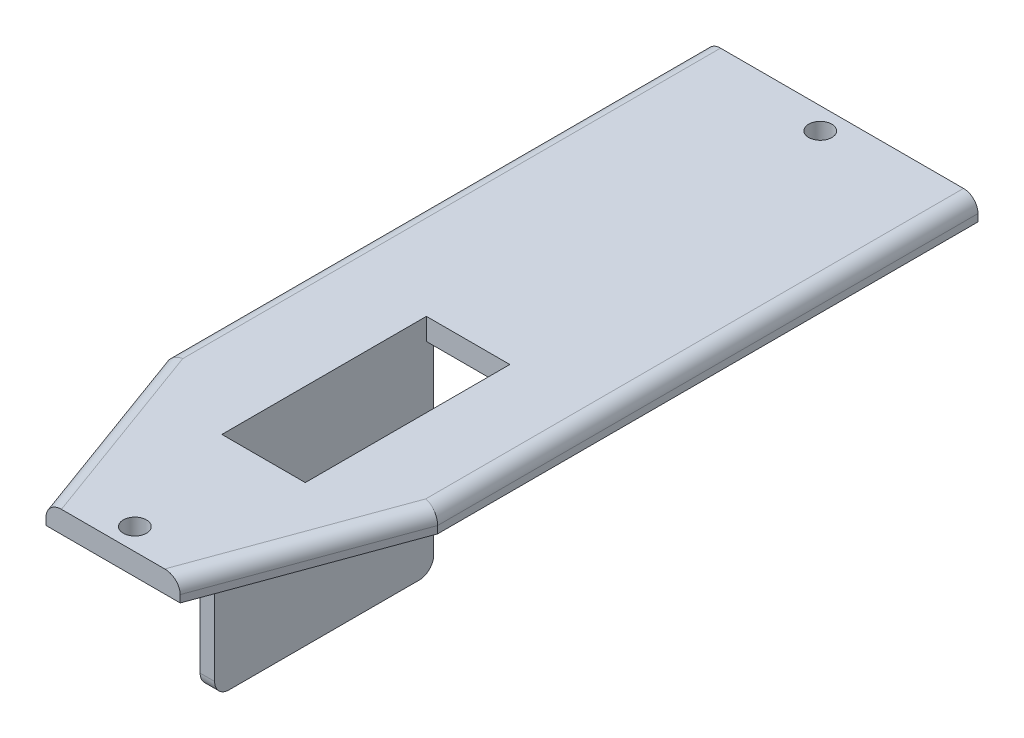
ISO-10303-21;
HEADER;
FILE_DESCRIPTION(('STEP AP214'),'2;1');
FILE_NAME('part.step','',(''),(''),'','','');
FILE_SCHEMA(('AUTOMOTIVE_DESIGN { 1 0 10303 214 1 1 1 1 }'));
ENDSEC;
DATA;
#1=APPLICATION_CONTEXT('core data for automotive mechanical design processes');
#2=APPLICATION_PROTOCOL_DEFINITION('international standard','automotive_design',2000,#1);
#3=PRODUCT_CONTEXT('',#1,'mechanical');
#4=PRODUCT('Part','Part','',(#3));
#5=PRODUCT_RELATED_PRODUCT_CATEGORY('part','',(#4));
#6=PRODUCT_DEFINITION_FORMATION('','',#4);
#7=PRODUCT_DEFINITION_CONTEXT('part definition',#1,'design');
#8=PRODUCT_DEFINITION('design','',#6,#7);
#9=PRODUCT_DEFINITION_SHAPE('','',#8);
#10=(LENGTH_UNIT() NAMED_UNIT(*) SI_UNIT(.MILLI.,.METRE.));
#11=(NAMED_UNIT(*) PLANE_ANGLE_UNIT() SI_UNIT($,.RADIAN.));
#12=(NAMED_UNIT(*) SI_UNIT($,.STERADIAN.) SOLID_ANGLE_UNIT());
#13=UNCERTAINTY_MEASURE_WITH_UNIT(LENGTH_MEASURE(1.E-05),#10,'distance_accuracy_value','');
#14=(GEOMETRIC_REPRESENTATION_CONTEXT(3) GLOBAL_UNCERTAINTY_ASSIGNED_CONTEXT((#13)) GLOBAL_UNIT_ASSIGNED_CONTEXT((#10,
#11,#12)) REPRESENTATION_CONTEXT('',''));
#15=CARTESIAN_POINT('',(0.,0.,0.));
#16=DIRECTION('',(0.,0.,1.));
#17=DIRECTION('',(1.,0.,0.));
#18=AXIS2_PLACEMENT_3D('',#15,#16,#17);
#19=CARTESIAN_POINT('',(-18.75,0.,24.25));
#20=DIRECTION('',(-1.,0.,0.));
#21=DIRECTION('',(0.,1.,0.));
#22=AXIS2_PLACEMENT_3D('',#19,#20,#21);
#23=PLANE('',#22);
#24=DIRECTION('',(0.,0.,1.));
#25=VECTOR('',#24,1.);
#26=CARTESIAN_POINT('',(-18.75,-2.,12.125));
#27=LINE('',#26,#25);
#28=CARTESIAN_POINT('',(-18.75,-2.,-50.25));
#29=VERTEX_POINT('',#28);
#30=CARTESIAN_POINT('',(-18.75,-2.,24.25));
#31=VERTEX_POINT('',#30);
#32=EDGE_CURVE('E570',#29,#31,#27,.T.);
#33=ORIENTED_EDGE('',*,*,#32,.F.);
#34=DIRECTION('',(0.,-1.,0.));
#35=VECTOR('',#34,1.);
#36=CARTESIAN_POINT('',(-18.75,0.,-50.25));
#37=LINE('',#36,#35);
#38=CARTESIAN_POINT('',(-18.75,-3.,-50.25));
#39=VERTEX_POINT('',#38);
#40=EDGE_CURVE('E10',#29,#39,#37,.T.);
#41=ORIENTED_EDGE('',*,*,#40,.T.);
#42=DIRECTION('',(0.,0.,-1.));
#43=VECTOR('',#42,1.);
#44=CARTESIAN_POINT('',(-18.75,-3.,-50.25));
#45=LINE('',#44,#43);
#46=CARTESIAN_POINT('',(-18.75,-3.,14.));
#47=VERTEX_POINT('',#46);
#48=EDGE_CURVE('E800',#47,#39,#45,.T.);
#49=ORIENTED_EDGE('',*,*,#48,.F.);
#50=DIRECTION('',(0.,0.,-1.));
#51=VECTOR('',#50,1.);
#52=CARTESIAN_POINT('',(-18.75,-3.,-50.25));
#53=LINE('',#52,#51);
#54=CARTESIAN_POINT('',(-18.75,-3.,15.));
#55=VERTEX_POINT('',#54);
#56=EDGE_CURVE('E566',#55,#47,#53,.T.);
#57=ORIENTED_EDGE('',*,*,#56,.F.);
#58=DIRECTION('',(0.,0.,-1.));
#59=VECTOR('',#58,1.);
#60=CARTESIAN_POINT('',(-18.75,-3.,-50.25));
#61=LINE('',#60,#59);
#62=CARTESIAN_POINT('',(-18.75,-3.,24.25));
#63=VERTEX_POINT('',#62);
#64=EDGE_CURVE('E544',#63,#55,#61,.T.);
#65=ORIENTED_EDGE('',*,*,#64,.F.);
#66=DIRECTION('',(0.,-1.,0.));
#67=VECTOR('',#66,1.);
#68=CARTESIAN_POINT('',(-18.75,0.,24.25));
#69=LINE('',#68,#67);
#70=EDGE_CURVE('E26',#31,#63,#69,.T.);
#71=ORIENTED_EDGE('',*,*,#70,.F.);
#72=EDGE_LOOP('',(#33,#41,#49,#57,#65,#71));
#73=FACE_BOUND('',#72,.T.);
#74=ADVANCED_FACE('F15',(#73),#23,.T.);
#75=CARTESIAN_POINT('',(-18.75,0.,-50.25));
#76=DIRECTION('',(0.,0.,-1.));
#77=DIRECTION('',(-1.,0.,0.));
#78=AXIS2_PLACEMENT_3D('',#75,#76,#77);
#79=PLANE('',#78);
#80=DIRECTION('',(-1.,0.,0.));
#81=VECTOR('',#80,1.);
#82=CARTESIAN_POINT('',(18.75,0.,-50.25));
#83=LINE('',#82,#81);
#84=CARTESIAN_POINT('',(16.75,0.,-50.25));
#85=VERTEX_POINT('',#84);
#86=CARTESIAN_POINT('',(-16.75,0.,-50.25));
#87=VERTEX_POINT('',#86);
#88=EDGE_CURVE('E19',#85,#87,#83,.T.);
#89=ORIENTED_EDGE('',*,*,#88,.F.);
#90=CARTESIAN_POINT('',(16.75,-2.,-50.25));
#91=DIRECTION('',(0.,0.,1.));
#92=DIRECTION('',(0.707106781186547,0.707106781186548,0.));
#93=AXIS2_PLACEMENT_3D('',#90,#91,#92);
#94=CIRCLE('',#93,2.);
#95=CARTESIAN_POINT('',(18.75,-2.,-50.25));
#96=VERTEX_POINT('',#95);
#97=EDGE_CURVE('E692',#96,#85,#94,.T.);
#98=ORIENTED_EDGE('',*,*,#97,.F.);
#99=DIRECTION('',(0.,-1.,0.));
#100=VECTOR('',#99,1.);
#101=CARTESIAN_POINT('',(18.75,0.,-50.25));
#102=LINE('',#101,#100);
#103=CARTESIAN_POINT('',(18.75,-3.,-50.25));
#104=VERTEX_POINT('',#103);
#105=EDGE_CURVE('E40',#96,#104,#102,.T.);
#106=ORIENTED_EDGE('',*,*,#105,.T.);
#107=DIRECTION('',(1.,0.,0.));
#108=VECTOR('',#107,1.);
#109=CARTESIAN_POINT('',(18.75,-3.,-50.25));
#110=LINE('',#109,#108);
#111=EDGE_CURVE('E795',#39,#104,#110,.T.);
#112=ORIENTED_EDGE('',*,*,#111,.F.);
#113=ORIENTED_EDGE('',*,*,#40,.F.);
#114=CARTESIAN_POINT('',(-16.75,-2.,-50.25));
#115=DIRECTION('',(0.,0.,1.));
#116=DIRECTION('',(-0.707106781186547,0.707106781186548,0.));
#117=AXIS2_PLACEMENT_3D('',#114,#115,#116);
#118=CIRCLE('',#117,2.);
#119=EDGE_CURVE('E574',#87,#29,#118,.T.);
#120=ORIENTED_EDGE('',*,*,#119,.F.);
#121=EDGE_LOOP('',(#89,#98,#106,#112,#113,#120));
#122=FACE_BOUND('',#121,.T.);
#123=ADVANCED_FACE('F1363',(#122),#79,.T.);
#124=CARTESIAN_POINT('',(-9.25,0.,50.25));
#125=DIRECTION('',(-0.939264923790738,0.,0.343192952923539));
#126=DIRECTION('',(0.,1.,0.));
#127=AXIS2_PLACEMENT_3D('',#124,#125,#126);
#128=PLANE('',#127);
#129=DIRECTION('',(0.343192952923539,0.,0.939264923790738));
#130=VECTOR('',#129,1.);
#131=CARTESIAN_POINT('',(-16.8042822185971,-2.,29.5751223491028));
#132=LINE('',#131,#130);
#133=CARTESIAN_POINT('',(-9.25,-2.,50.25));
#134=VERTEX_POINT('',#133);
#135=EDGE_CURVE('E583',#31,#134,#132,.T.);
#136=ORIENTED_EDGE('',*,*,#135,.F.);
#137=ORIENTED_EDGE('',*,*,#70,.T.);
#138=DIRECTION('',(-0.343192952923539,0.,-0.939264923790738));
#139=VECTOR('',#138,1.);
#140=CARTESIAN_POINT('',(-18.75,-3.,24.25));
#141=LINE('',#140,#139);
#142=CARTESIAN_POINT('',(-9.25,-3.,50.25));
#143=VERTEX_POINT('',#142);
#144=EDGE_CURVE('E548',#143,#63,#141,.T.);
#145=ORIENTED_EDGE('',*,*,#144,.F.);
#146=DIRECTION('',(0.,-1.,0.));
#147=VECTOR('',#146,1.);
#148=CARTESIAN_POINT('',(-9.25,0.,50.25));
#149=LINE('',#148,#147);
#150=EDGE_CURVE('E850',#134,#143,#149,.T.);
#151=ORIENTED_EDGE('',*,*,#150,.F.);
#152=EDGE_LOOP('',(#136,#137,#145,#151));
#153=FACE_BOUND('',#152,.T.);
#154=ADVANCED_FACE('F1377',(#153),#128,.T.);
#155=CARTESIAN_POINT('',(-5.,0.,2.05));
#156=DIRECTION('',(0.,0.,-1.));
#157=DIRECTION('',(-1.,0.,0.));
#158=AXIS2_PLACEMENT_3D('',#155,#156,#157);
#159=PLANE('',#158);
#160=DIRECTION('',(-1.,0.,0.));
#161=VECTOR('',#160,1.);
#162=CARTESIAN_POINT('',(-2.5,-3.,2.05));
#163=LINE('',#162,#161);
#164=CARTESIAN_POINT('',(6.5,-3.,2.05));
#165=VERTEX_POINT('',#164);
#166=CARTESIAN_POINT('',(-5.,-3.,2.05));
#167=VERTEX_POINT('',#166);
#168=EDGE_CURVE('E665',#165,#167,#163,.T.);
#169=ORIENTED_EDGE('',*,*,#168,.F.);
#170=DIRECTION('',(0.,-1.,0.));
#171=VECTOR('',#170,1.);
#172=CARTESIAN_POINT('',(6.5,0.,2.05));
#173=LINE('',#172,#171);
#174=CARTESIAN_POINT('',(6.5,0.,2.05));
#175=VERTEX_POINT('',#174);
#176=EDGE_CURVE('E746',#175,#165,#173,.T.);
#177=ORIENTED_EDGE('',*,*,#176,.F.);
#178=DIRECTION('',(1.,0.,0.));
#179=VECTOR('',#178,1.);
#180=CARTESIAN_POINT('',(-2.5,0.,2.05));
#181=LINE('',#180,#179);
#182=CARTESIAN_POINT('',(-5.,0.,2.05));
#183=VERTEX_POINT('',#182);
#184=EDGE_CURVE('E671',#183,#175,#181,.T.);
#185=ORIENTED_EDGE('',*,*,#184,.F.);
#186=DIRECTION('',(0.,-1.,0.));
#187=VECTOR('',#186,1.);
#188=CARTESIAN_POINT('',(-5.,0.,2.05));
#189=LINE('',#188,#187);
#190=EDGE_CURVE('E604',#183,#167,#189,.T.);
#191=ORIENTED_EDGE('',*,*,#190,.T.);
#192=EDGE_LOOP('',(#169,#177,#185,#191));
#193=FACE_BOUND('',#192,.T.);
#194=ADVANCED_FACE('F2006',(#193),#159,.F.);
#195=CARTESIAN_POINT('',(6.5,0.,2.05));
#196=DIRECTION('',(1.,0.,0.));
#197=DIRECTION('',(0.,0.,-1.));
#198=AXIS2_PLACEMENT_3D('',#195,#196,#197);
#199=PLANE('',#198);
#200=DIRECTION('',(0.,0.,-1.));
#201=VECTOR('',#200,1.);
#202=CARTESIAN_POINT('',(6.5,-3.,1.025));
#203=LINE('',#202,#201);
#204=CARTESIAN_POINT('',(6.5,-3.,30.25));
#205=VERTEX_POINT('',#204);
#206=EDGE_CURVE('E610',#205,#165,#203,.T.);
#207=ORIENTED_EDGE('',*,*,#206,.F.);
#208=DIRECTION('',(0.,-1.,0.));
#209=VECTOR('',#208,1.);
#210=CARTESIAN_POINT('',(6.5,0.,30.25));
#211=LINE('',#210,#209);
#212=CARTESIAN_POINT('',(6.5,0.,30.25));
#213=VERTEX_POINT('',#212);
#214=EDGE_CURVE('E742',#213,#205,#211,.T.);
#215=ORIENTED_EDGE('',*,*,#214,.F.);
#216=DIRECTION('',(0.,0.,1.));
#217=VECTOR('',#216,1.);
#218=CARTESIAN_POINT('',(6.5,0.,1.025));
#219=LINE('',#218,#217);
#220=EDGE_CURVE('E675',#175,#213,#219,.T.);
#221=ORIENTED_EDGE('',*,*,#220,.F.);
#222=ORIENTED_EDGE('',*,*,#176,.T.);
#223=EDGE_LOOP('',(#207,#215,#221,#222));
#224=FACE_BOUND('',#223,.T.);
#225=ADVANCED_FACE('F2003',(#224),#199,.F.);
#226=CARTESIAN_POINT('',(6.5,0.,30.25));
#227=DIRECTION('',(0.,0.,1.));
#228=DIRECTION('',(1.,0.,0.));
#229=AXIS2_PLACEMENT_3D('',#226,#227,#228);
#230=PLANE('',#229);
#231=DIRECTION('',(1.,0.,0.));
#232=VECTOR('',#231,1.);
#233=CARTESIAN_POINT('',(3.25,-3.,30.25));
#234=LINE('',#233,#232);
#235=CARTESIAN_POINT('',(-5.,-3.,30.25));
#236=VERTEX_POINT('',#235);
#237=EDGE_CURVE('E606',#236,#205,#234,.T.);
#238=ORIENTED_EDGE('',*,*,#237,.F.);
#239=DIRECTION('',(0.,-1.,0.));
#240=VECTOR('',#239,1.);
#241=CARTESIAN_POINT('',(-5.,0.,30.25));
#242=LINE('',#241,#240);
#243=CARTESIAN_POINT('',(-5.,0.,30.25));
#244=VERTEX_POINT('',#243);
#245=EDGE_CURVE('E603',#244,#236,#242,.T.);
#246=ORIENTED_EDGE('',*,*,#245,.F.);
#247=DIRECTION('',(-1.,0.,0.));
#248=VECTOR('',#247,1.);
#249=CARTESIAN_POINT('',(3.25,0.,30.25));
#250=LINE('',#249,#248);
#251=EDGE_CURVE('E822',#213,#244,#250,.T.);
#252=ORIENTED_EDGE('',*,*,#251,.F.);
#253=ORIENTED_EDGE('',*,*,#214,.T.);
#254=EDGE_LOOP('',(#238,#246,#252,#253));
#255=FACE_BOUND('',#254,.T.);
#256=ADVANCED_FACE('F1999',(#255),#230,.F.);
#257=CARTESIAN_POINT('',(18.75,0.,24.25));
#258=DIRECTION('',(0.939264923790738,0.,0.343192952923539));
#259=DIRECTION('',(0.,-1.,0.));
#260=AXIS2_PLACEMENT_3D('',#257,#258,#259);
#261=PLANE('',#260);
#262=DIRECTION('',(0.343192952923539,0.,-0.939264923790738));
#263=VECTOR('',#262,1.);
#264=CARTESIAN_POINT('',(21.5542822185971,-2.,16.5751223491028));
#265=LINE('',#264,#263);
#266=CARTESIAN_POINT('',(9.25,-2.,50.25));
#267=VERTEX_POINT('',#266);
#268=CARTESIAN_POINT('',(18.75,-2.,24.25));
#269=VERTEX_POINT('',#268);
#270=EDGE_CURVE('E697',#267,#269,#265,.T.);
#271=ORIENTED_EDGE('',*,*,#270,.F.);
#272=DIRECTION('',(0.,-1.,0.));
#273=VECTOR('',#272,1.);
#274=CARTESIAN_POINT('',(9.25,0.,50.25));
#275=LINE('',#274,#273);
#276=CARTESIAN_POINT('',(9.25,-3.,50.25));
#277=VERTEX_POINT('',#276);
#278=EDGE_CURVE('E737',#267,#277,#275,.T.);
#279=ORIENTED_EDGE('',*,*,#278,.T.);
#280=DIRECTION('',(-0.343192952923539,0.,0.939264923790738));
#281=VECTOR('',#280,1.);
#282=CARTESIAN_POINT('',(9.25,-3.,50.25));
#283=LINE('',#282,#281);
#284=CARTESIAN_POINT('',(18.75,-3.,24.25));
#285=VERTEX_POINT('',#284);
#286=EDGE_CURVE('E1003',#285,#277,#283,.T.);
#287=ORIENTED_EDGE('',*,*,#286,.F.);
#288=DIRECTION('',(0.,-1.,0.));
#289=VECTOR('',#288,1.);
#290=CARTESIAN_POINT('',(18.75,0.,24.25));
#291=LINE('',#290,#289);
#292=EDGE_CURVE('E1293',#269,#285,#291,.T.);
#293=ORIENTED_EDGE('',*,*,#292,.F.);
#294=EDGE_LOOP('',(#271,#279,#287,#293));
#295=FACE_BOUND('',#294,.T.);
#296=ADVANCED_FACE('F1368',(#295),#261,.T.);
#297=CARTESIAN_POINT('',(18.75,0.,-50.25));
#298=DIRECTION('',(1.,0.,0.));
#299=DIRECTION('',(0.,0.,-1.));
#300=AXIS2_PLACEMENT_3D('',#297,#298,#299);
#301=PLANE('',#300);
#302=DIRECTION('',(0.,0.,-1.));
#303=VECTOR('',#302,1.);
#304=CARTESIAN_POINT('',(18.75,-2.,-25.125));
#305=LINE('',#304,#303);
#306=EDGE_CURVE('E689',#269,#96,#305,.T.);
#307=ORIENTED_EDGE('',*,*,#306,.F.);
#308=ORIENTED_EDGE('',*,*,#292,.T.);
#309=DIRECTION('',(0.,0.,1.));
#310=VECTOR('',#309,1.);
#311=CARTESIAN_POINT('',(18.75,-3.,50.25));
#312=LINE('',#311,#310);
#313=EDGE_CURVE('E799',#104,#285,#312,.T.);
#314=ORIENTED_EDGE('',*,*,#313,.F.);
#315=ORIENTED_EDGE('',*,*,#105,.F.);
#316=EDGE_LOOP('',(#307,#308,#314,#315));
#317=FACE_BOUND('',#316,.T.);
#318=ADVANCED_FACE('F1364',(#317),#301,.T.);
#319=CARTESIAN_POINT('',(16.75,-2.,-25.125));
#320=DIRECTION('',(0.,0.,-1.));
#321=DIRECTION('',(0.707106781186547,0.707106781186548,0.));
#322=AXIS2_PLACEMENT_3D('',#319,#320,#321);
#323=CYLINDRICAL_SURFACE('',#322,2.);
#324=ORIENTED_EDGE('',*,*,#306,.T.);
#325=ORIENTED_EDGE('',*,*,#97,.T.);
#326=DIRECTION('',(0.,0.,1.));
#327=VECTOR('',#326,1.);
#328=CARTESIAN_POINT('',(16.75,0.,-25.125));
#329=LINE('',#328,#327);
#330=CARTESIAN_POINT('',(16.75,0.,23.8960587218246));
#331=VERTEX_POINT('',#330);
#332=EDGE_CURVE('E969',#85,#331,#329,.T.);
#333=ORIENTED_EDGE('',*,*,#332,.T.);
#334=CARTESIAN_POINT('',(16.75,-2.,23.8960587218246));
#335=DIRECTION('',(-0.174262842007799,0.,0.984699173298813));
#336=DIRECTION('',(-0.984699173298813,0.,-0.174262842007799));
#337=AXIS2_PLACEMENT_3D('',#334,#335,#336);
#338=ELLIPSE('',#337,2.03107715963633,2.);
#339=EDGE_CURVE('E693',#269,#331,#338,.T.);
#340=ORIENTED_EDGE('',*,*,#339,.F.);
#341=EDGE_LOOP('',(#324,#325,#333,#340));
#342=FACE_BOUND('',#341,.T.);
#343=ADVANCED_FACE('F2077',(#342),#323,.T.);
#344=CARTESIAN_POINT('',(19.6757523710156,-2.,15.8887364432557));
#345=DIRECTION('',(0.343192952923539,0.,-0.939264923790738));
#346=DIRECTION('',(0.664160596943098,0.707106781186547,0.24267406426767));
#347=AXIS2_PLACEMENT_3D('',#344,#345,#346);
#348=CYLINDRICAL_SURFACE('',#347,2.);
#349=DIRECTION('',(-0.343192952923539,0.,0.939264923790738));
#350=VECTOR('',#349,1.);
#351=CARTESIAN_POINT('',(19.6757523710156,0.,15.8887364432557));
#352=LINE('',#351,#350);
#353=CARTESIAN_POINT('',(7.12067530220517,0.,50.25));
#354=VERTEX_POINT('',#353);
#355=EDGE_CURVE('E973',#331,#354,#352,.T.);
#356=ORIENTED_EDGE('',*,*,#355,.T.);
#357=CARTESIAN_POINT('',(7.12067530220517,-2.,50.25));
#358=DIRECTION('',(0.,0.,-1.));
#359=DIRECTION('',(1.,0.,0.));
#360=AXIS2_PLACEMENT_3D('',#357,#358,#359);
#361=ELLIPSE('',#360,2.12932469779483,2.);
#362=EDGE_CURVE('E733',#354,#267,#361,.T.);
#363=ORIENTED_EDGE('',*,*,#362,.T.);
#364=ORIENTED_EDGE('',*,*,#270,.T.);
#365=ORIENTED_EDGE('',*,*,#339,.T.);
#366=EDGE_LOOP('',(#356,#363,#364,#365));
#367=FACE_BOUND('',#366,.T.);
#368=ADVANCED_FACE('F2126',(#367),#348,.T.);
#369=CARTESIAN_POINT('',(9.25,0.,50.25));
#370=DIRECTION('',(0.,0.,1.));
#371=DIRECTION('',(1.,0.,0.));
#372=AXIS2_PLACEMENT_3D('',#369,#370,#371);
#373=PLANE('',#372);
#374=DIRECTION('',(1.,0.,0.));
#375=VECTOR('',#374,1.);
#376=CARTESIAN_POINT('',(-18.75,0.,50.25));
#377=LINE('',#376,#375);
#378=CARTESIAN_POINT('',(-7.12067530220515,0.,50.25));
#379=VERTEX_POINT('',#378);
#380=EDGE_CURVE('E1065',#379,#354,#377,.T.);
#381=ORIENTED_EDGE('',*,*,#380,.F.);
#382=CARTESIAN_POINT('',(-7.12067530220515,-2.,50.25));
#383=DIRECTION('',(0.,0.,-1.));
#384=DIRECTION('',(-1.,0.,0.));
#385=AXIS2_PLACEMENT_3D('',#382,#383,#384);
#386=ELLIPSE('',#385,2.12932469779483,2.);
#387=EDGE_CURVE('E779',#134,#379,#386,.T.);
#388=ORIENTED_EDGE('',*,*,#387,.F.);
#389=ORIENTED_EDGE('',*,*,#150,.T.);
#390=DIRECTION('',(-1.,0.,0.));
#391=VECTOR('',#390,1.);
#392=CARTESIAN_POINT('',(-18.75,-3.,50.25));
#393=LINE('',#392,#391);
#394=EDGE_CURVE('E818',#277,#143,#393,.T.);
#395=ORIENTED_EDGE('',*,*,#394,.F.);
#396=ORIENTED_EDGE('',*,*,#278,.F.);
#397=ORIENTED_EDGE('',*,*,#362,.F.);
#398=EDGE_LOOP('',(#381,#388,#389,#395,#396,#397));
#399=FACE_BOUND('',#398,.T.);
#400=ADVANCED_FACE('F1372',(#399),#373,.T.);
#401=CARTESIAN_POINT('',(0.,0.,0.));
#402=DIRECTION('',(0.,1.,0.));
#403=DIRECTION('',(1.,0.,0.));
#404=AXIS2_PLACEMENT_3D('',#401,#402,#403);
#405=PLANE('',#404);
#406=ORIENTED_EDGE('',*,*,#184,.T.);
#407=ORIENTED_EDGE('',*,*,#220,.T.);
#408=ORIENTED_EDGE('',*,*,#251,.T.);
#409=DIRECTION('',(0.,0.,-1.));
#410=VECTOR('',#409,1.);
#411=CARTESIAN_POINT('',(-5.,0.,15.125));
#412=LINE('',#411,#410);
#413=EDGE_CURVE('E600',#244,#183,#412,.T.);
#414=ORIENTED_EDGE('',*,*,#413,.T.);
#415=EDGE_LOOP('',(#406,#407,#408,#414));
#416=FACE_BOUND('',#415,.T.);
#417=CARTESIAN_POINT('',(0.,0.,47.25));
#418=DIRECTION('',(0.,-1.,0.));
#419=DIRECTION('',(1.,0.,0.));
#420=AXIS2_PLACEMENT_3D('',#417,#418,#419);
#421=CIRCLE('',#420,1.6);
#422=CARTESIAN_POINT('',(-1.6,0.,47.25));
#423=VERTEX_POINT('',#422);
#424=EDGE_CURVE('E922',#423,#423,#421,.T.);
#425=ORIENTED_EDGE('',*,*,#424,.T.);
#426=EDGE_LOOP('',(#425));
#427=FACE_BOUND('',#426,.T.);
#428=CARTESIAN_POINT('',(0.,0.,-47.25));
#429=DIRECTION('',(0.,-1.,0.));
#430=DIRECTION('',(1.,0.,0.));
#431=AXIS2_PLACEMENT_3D('',#428,#429,#430);
#432=CIRCLE('',#431,1.6);
#433=CARTESIAN_POINT('',(-1.6,0.,-47.25));
#434=VERTEX_POINT('',#433);
#435=EDGE_CURVE('E644',#434,#434,#432,.T.);
#436=ORIENTED_EDGE('',*,*,#435,.T.);
#437=EDGE_LOOP('',(#436));
#438=FACE_BOUND('',#437,.T.);
#439=ORIENTED_EDGE('',*,*,#380,.T.);
#440=ORIENTED_EDGE('',*,*,#355,.F.);
#441=ORIENTED_EDGE('',*,*,#332,.F.);
#442=ORIENTED_EDGE('',*,*,#88,.T.);
#443=DIRECTION('',(0.,0.,-1.));
#444=VECTOR('',#443,1.);
#445=CARTESIAN_POINT('',(-16.75,0.,12.125));
#446=LINE('',#445,#444);
#447=CARTESIAN_POINT('',(-16.75,0.,23.8960587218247));
#448=VERTEX_POINT('',#447);
#449=EDGE_CURVE('E526',#448,#87,#446,.T.);
#450=ORIENTED_EDGE('',*,*,#449,.F.);
#451=DIRECTION('',(-0.343192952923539,0.,-0.939264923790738));
#452=VECTOR('',#451,1.);
#453=CARTESIAN_POINT('',(-14.9257523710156,0.,28.8887364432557));
#454=LINE('',#453,#452);
#455=EDGE_CURVE('E1069',#379,#448,#454,.T.);
#456=ORIENTED_EDGE('',*,*,#455,.F.);
#457=EDGE_LOOP('',(#439,#440,#441,#442,#450,#456));
#458=FACE_BOUND('',#457,.T.);
#459=ADVANCED_FACE('F1386',(#416,#427,#438,#458),#405,.T.);
#460=CARTESIAN_POINT('',(-14.9257523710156,-2.,28.8887364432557));
#461=DIRECTION('',(0.343192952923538,0.,0.939264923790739));
#462=DIRECTION('',(-0.664160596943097,0.707106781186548,0.242674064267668));
#463=AXIS2_PLACEMENT_3D('',#460,#461,#462);
#464=CYLINDRICAL_SURFACE('',#463,2.);
#465=ORIENTED_EDGE('',*,*,#135,.T.);
#466=ORIENTED_EDGE('',*,*,#387,.T.);
#467=ORIENTED_EDGE('',*,*,#455,.T.);
#468=CARTESIAN_POINT('',(-16.75,-2.,23.8960587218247));
#469=DIRECTION('',(-0.174262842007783,0.,-0.984699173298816));
#470=DIRECTION('',(0.984699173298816,0.,-0.174262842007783));
#471=AXIS2_PLACEMENT_3D('',#468,#469,#470);
#472=ELLIPSE('',#471,2.03107715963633,2.);
#473=EDGE_CURVE('E573',#31,#448,#472,.T.);
#474=ORIENTED_EDGE('',*,*,#473,.F.);
#475=EDGE_LOOP('',(#465,#466,#467,#474));
#476=FACE_BOUND('',#475,.T.);
#477=ADVANCED_FACE('F1381',(#476),#464,.T.);
#478=CARTESIAN_POINT('',(-16.75,-2.,12.125));
#479=DIRECTION('',(0.,0.,1.));
#480=DIRECTION('',(-0.707106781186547,0.707106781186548,0.));
#481=AXIS2_PLACEMENT_3D('',#478,#479,#480);
#482=CYLINDRICAL_SURFACE('',#481,2.);
#483=ORIENTED_EDGE('',*,*,#449,.T.);
#484=ORIENTED_EDGE('',*,*,#119,.T.);
#485=ORIENTED_EDGE('',*,*,#32,.T.);
#486=ORIENTED_EDGE('',*,*,#473,.T.);
#487=EDGE_LOOP('',(#483,#484,#485,#486));
#488=FACE_BOUND('',#487,.T.);
#489=ADVANCED_FACE('F1384',(#488),#482,.T.);
#490=CARTESIAN_POINT('',(-17.75,0.,24.25));
#491=DIRECTION('',(-1.,0.,0.));
#492=DIRECTION('',(0.,1.,0.));
#493=AXIS2_PLACEMENT_3D('',#490,#491,#492);
#494=PLANE('',#493);
#495=DIRECTION('',(0.,1.,0.));
#496=VECTOR('',#495,1.);
#497=CARTESIAN_POINT('',(-17.75,-8.,15.));
#498=LINE('',#497,#496);
#499=CARTESIAN_POINT('',(-17.75,-3.,15.));
#500=VERTEX_POINT('',#499);
#501=CARTESIAN_POINT('',(-17.75,-2.,15.));
#502=VERTEX_POINT('',#501);
#503=EDGE_CURVE('E661',#500,#502,#498,.T.);
#504=ORIENTED_EDGE('',*,*,#503,.T.);
#505=DIRECTION('',(0.,0.,1.));
#506=VECTOR('',#505,1.);
#507=CARTESIAN_POINT('',(-17.75,-2.,12.125));
#508=LINE('',#507,#506);
#509=CARTESIAN_POINT('',(-17.75,-2.,24.0730293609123));
#510=VERTEX_POINT('',#509);
#511=EDGE_CURVE('E670',#502,#510,#508,.T.);
#512=ORIENTED_EDGE('',*,*,#511,.T.);
#513=DIRECTION('',(0.,-1.,0.));
#514=VECTOR('',#513,1.);
#515=CARTESIAN_POINT('',(-17.75,0.,24.0730293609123));
#516=LINE('',#515,#514);
#517=CARTESIAN_POINT('',(-17.75,-3.,24.0730293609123));
#518=VERTEX_POINT('',#517);
#519=EDGE_CURVE('E591',#510,#518,#516,.T.);
#520=ORIENTED_EDGE('',*,*,#519,.T.);
#521=DIRECTION('',(0.,0.,1.));
#522=VECTOR('',#521,1.);
#523=CARTESIAN_POINT('',(-17.75,-3.,12.125));
#524=LINE('',#523,#522);
#525=EDGE_CURVE('E533',#500,#518,#524,.T.);
#526=ORIENTED_EDGE('',*,*,#525,.F.);
#527=EDGE_LOOP('',(#504,#512,#520,#526));
#528=FACE_BOUND('',#527,.T.);
#529=ADVANCED_FACE('F1967',(#528),#494,.F.);
#530=CARTESIAN_POINT('',(-8.31073507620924,0.,49.9068070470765));
#531=DIRECTION('',(-0.939264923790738,0.,0.343192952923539));
#532=DIRECTION('',(0.,1.,0.));
#533=AXIS2_PLACEMENT_3D('',#530,#531,#532);
#534=PLANE('',#533);
#535=DIRECTION('',(0.343192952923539,0.,0.939264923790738));
#536=VECTOR('',#535,1.);
#537=CARTESIAN_POINT('',(-15.8650172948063,-2.,29.2319293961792));
#538=LINE('',#537,#536);
#539=CARTESIAN_POINT('',(-8.55072226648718,-2.,49.25));
#540=VERTEX_POINT('',#539);
#541=EDGE_CURVE('E666',#510,#540,#538,.T.);
#542=ORIENTED_EDGE('',*,*,#541,.T.);
#543=DIRECTION('',(0.,-1.,0.));
#544=VECTOR('',#543,1.);
#545=CARTESIAN_POINT('',(-8.55072226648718,0.,49.25));
#546=LINE('',#545,#544);
#547=CARTESIAN_POINT('',(-8.55072226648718,-3.,49.25));
#548=VERTEX_POINT('',#547);
#549=EDGE_CURVE('E658',#540,#548,#546,.T.);
#550=ORIENTED_EDGE('',*,*,#549,.T.);
#551=DIRECTION('',(0.343192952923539,0.,0.939264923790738));
#552=VECTOR('',#551,1.);
#553=CARTESIAN_POINT('',(-15.8650172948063,-3.,29.2319293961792));
#554=LINE('',#553,#552);
#555=EDGE_CURVE('E537',#518,#548,#554,.T.);
#556=ORIENTED_EDGE('',*,*,#555,.F.);
#557=ORIENTED_EDGE('',*,*,#519,.F.);
#558=EDGE_LOOP('',(#542,#550,#556,#557));
#559=FACE_BOUND('',#558,.T.);
#560=ADVANCED_FACE('F1971',(#559),#534,.F.);
#561=CARTESIAN_POINT('',(7.5,0.,2.05));
#562=DIRECTION('',(1.,0.,0.));
#563=DIRECTION('',(0.,0.,-1.));
#564=AXIS2_PLACEMENT_3D('',#561,#562,#563);
#565=PLANE('',#564);
#566=DIRECTION('',(0.,0.,1.));
#567=VECTOR('',#566,1.);
#568=CARTESIAN_POINT('',(7.5,-3.,1.025));
#569=LINE('',#568,#567);
#570=CARTESIAN_POINT('',(7.5,-3.,1.05));
#571=VERTEX_POINT('',#570);
#572=CARTESIAN_POINT('',(7.5,-3.,31.25));
#573=VERTEX_POINT('',#572);
#574=EDGE_CURVE('E708',#571,#573,#569,.T.);
#575=ORIENTED_EDGE('',*,*,#574,.F.);
#576=DIRECTION('',(0.,-1.,0.));
#577=VECTOR('',#576,1.);
#578=CARTESIAN_POINT('',(7.5,0.,1.05));
#579=LINE('',#578,#577);
#580=CARTESIAN_POINT('',(7.5,-1.,1.05));
#581=VERTEX_POINT('',#580);
#582=EDGE_CURVE('E1007',#581,#571,#579,.T.);
#583=ORIENTED_EDGE('',*,*,#582,.F.);
#584=DIRECTION('',(0.,0.,1.));
#585=VECTOR('',#584,1.);
#586=CARTESIAN_POINT('',(7.5,-1.,1.025));
#587=LINE('',#586,#585);
#588=CARTESIAN_POINT('',(7.5,-1.,31.25));
#589=VERTEX_POINT('',#588);
#590=EDGE_CURVE('E542',#581,#589,#587,.T.);
#591=ORIENTED_EDGE('',*,*,#590,.T.);
#592=DIRECTION('',(0.,-1.,0.));
#593=VECTOR('',#592,1.);
#594=CARTESIAN_POINT('',(7.5,0.,31.25));
#595=LINE('',#594,#593);
#596=EDGE_CURVE('E870',#589,#573,#595,.T.);
#597=ORIENTED_EDGE('',*,*,#596,.T.);
#598=EDGE_LOOP('',(#575,#583,#591,#597));
#599=FACE_BOUND('',#598,.T.);
#600=ADVANCED_FACE('F2055',(#599),#565,.T.);
#601=CARTESIAN_POINT('',(6.5,0.,31.25));
#602=DIRECTION('',(0.,0.,1.));
#603=DIRECTION('',(1.,0.,0.));
#604=AXIS2_PLACEMENT_3D('',#601,#602,#603);
#605=PLANE('',#604);
#606=DIRECTION('',(0.,-1.,0.));
#607=VECTOR('',#606,1.);
#608=CARTESIAN_POINT('',(1.,-0.5,31.25));
#609=LINE('',#608,#607);
#610=CARTESIAN_POINT('',(1.,-1.,31.25));
#611=VERTEX_POINT('',#610);
#612=CARTESIAN_POINT('',(1.,-3.,31.25));
#613=VERTEX_POINT('',#612);
#614=EDGE_CURVE('E627',#611,#613,#609,.T.);
#615=ORIENTED_EDGE('',*,*,#614,.T.);
#616=DIRECTION('',(-1.,0.,0.));
#617=VECTOR('',#616,1.);
#618=CARTESIAN_POINT('',(3.25,-3.,31.25));
#619=LINE('',#618,#617);
#620=EDGE_CURVE('E703',#573,#613,#619,.T.);
#621=ORIENTED_EDGE('',*,*,#620,.F.);
#622=ORIENTED_EDGE('',*,*,#596,.F.);
#623=DIRECTION('',(-1.,0.,0.));
#624=VECTOR('',#623,1.);
#625=CARTESIAN_POINT('',(3.25,-1.,31.25));
#626=LINE('',#625,#624);
#627=EDGE_CURVE('E539',#589,#611,#626,.T.);
#628=ORIENTED_EDGE('',*,*,#627,.T.);
#629=EDGE_LOOP('',(#615,#621,#622,#628));
#630=FACE_BOUND('',#629,.T.);
#631=ADVANCED_FACE('F2058',(#630),#605,.T.);
#632=CARTESIAN_POINT('',(17.8107350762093,0.,23.9068070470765));
#633=DIRECTION('',(0.939264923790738,0.,0.343192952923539));
#634=DIRECTION('',(0.,-1.,0.));
#635=AXIS2_PLACEMENT_3D('',#632,#633,#634);
#636=PLANE('',#635);
#637=DIRECTION('',(0.343192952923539,0.,-0.939264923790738));
#638=VECTOR('',#637,1.);
#639=CARTESIAN_POINT('',(20.6150172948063,-2.,16.2319293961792));
#640=LINE('',#639,#638);
#641=CARTESIAN_POINT('',(8.5507222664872,-2.,49.25));
#642=VERTEX_POINT('',#641);
#643=CARTESIAN_POINT('',(17.75,-2.,24.0730293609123));
#644=VERTEX_POINT('',#643);
#645=EDGE_CURVE('E756',#642,#644,#640,.T.);
#646=ORIENTED_EDGE('',*,*,#645,.T.);
#647=DIRECTION('',(0.,-1.,0.));
#648=VECTOR('',#647,1.);
#649=CARTESIAN_POINT('',(17.75,0.,24.0730293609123));
#650=LINE('',#649,#648);
#651=CARTESIAN_POINT('',(17.75,-3.,24.0730293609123));
#652=VERTEX_POINT('',#651);
#653=EDGE_CURVE('E755',#644,#652,#650,.T.);
#654=ORIENTED_EDGE('',*,*,#653,.T.);
#655=DIRECTION('',(0.343192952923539,0.,-0.939264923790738));
#656=VECTOR('',#655,1.);
#657=CARTESIAN_POINT('',(20.6150172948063,-3.,16.2319293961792));
#658=LINE('',#657,#656);
#659=CARTESIAN_POINT('',(8.5507222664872,-3.,49.25));
#660=VERTEX_POINT('',#659);
#661=EDGE_CURVE('E522',#660,#652,#658,.T.);
#662=ORIENTED_EDGE('',*,*,#661,.F.);
#663=DIRECTION('',(0.,-1.,0.));
#664=VECTOR('',#663,1.);
#665=CARTESIAN_POINT('',(8.5507222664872,0.,49.25));
#666=LINE('',#665,#664);
#667=EDGE_CURVE('E1010',#642,#660,#666,.T.);
#668=ORIENTED_EDGE('',*,*,#667,.F.);
#669=EDGE_LOOP('',(#646,#654,#662,#668));
#670=FACE_BOUND('',#669,.T.);
#671=ADVANCED_FACE('F2073',(#670),#636,.F.);
#672=CARTESIAN_POINT('',(17.75,0.,-50.25));
#673=DIRECTION('',(1.,0.,0.));
#674=DIRECTION('',(0.,0.,-1.));
#675=AXIS2_PLACEMENT_3D('',#672,#673,#674);
#676=PLANE('',#675);
#677=DIRECTION('',(0.,0.,-1.));
#678=VECTOR('',#677,1.);
#679=CARTESIAN_POINT('',(17.75,-2.,-25.125));
#680=LINE('',#679,#678);
#681=CARTESIAN_POINT('',(17.75,-2.,-49.25));
#682=VERTEX_POINT('',#681);
#683=EDGE_CURVE('E751',#644,#682,#680,.T.);
#684=ORIENTED_EDGE('',*,*,#683,.T.);
#685=DIRECTION('',(0.,-1.,0.));
#686=VECTOR('',#685,1.);
#687=CARTESIAN_POINT('',(17.75,0.,-49.25));
#688=LINE('',#687,#686);
#689=CARTESIAN_POINT('',(17.75,-3.,-49.25));
#690=VERTEX_POINT('',#689);
#691=EDGE_CURVE('E929',#682,#690,#688,.T.);
#692=ORIENTED_EDGE('',*,*,#691,.T.);
#693=DIRECTION('',(0.,0.,-1.));
#694=VECTOR('',#693,1.);
#695=CARTESIAN_POINT('',(17.75,-3.,-25.125));
#696=LINE('',#695,#694);
#697=EDGE_CURVE('E515',#652,#690,#696,.T.);
#698=ORIENTED_EDGE('',*,*,#697,.F.);
#699=ORIENTED_EDGE('',*,*,#653,.F.);
#700=EDGE_LOOP('',(#684,#692,#698,#699));
#701=FACE_BOUND('',#700,.T.);
#702=ADVANCED_FACE('F2048',(#701),#676,.F.);
#703=CARTESIAN_POINT('',(16.75,-2.,-25.125));
#704=DIRECTION('',(0.,0.,-1.));
#705=DIRECTION('',(0.707106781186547,0.707106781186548,0.));
#706=AXIS2_PLACEMENT_3D('',#703,#704,#705);
#707=CYLINDRICAL_SURFACE('',#706,1.);
#708=ORIENTED_EDGE('',*,*,#683,.F.);
#709=CARTESIAN_POINT('',(16.75,-2.,23.8960587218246));
#710=DIRECTION('',(-0.17426284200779,0.,0.984699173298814));
#711=DIRECTION('',(0.984699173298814,0.,0.17426284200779));
#712=AXIS2_PLACEMENT_3D('',#709,#710,#711);
#713=ELLIPSE('',#712,1.01553857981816,1.);
#714=CARTESIAN_POINT('',(16.75,-1.,23.8960587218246));
#715=VERTEX_POINT('',#714);
#716=EDGE_CURVE('E669',#644,#715,#713,.T.);
#717=ORIENTED_EDGE('',*,*,#716,.T.);
#718=DIRECTION('',(0.,0.,1.));
#719=VECTOR('',#718,1.);
#720=CARTESIAN_POINT('',(16.75,-1.,-25.125));
#721=LINE('',#720,#719);
#722=CARTESIAN_POINT('',(16.75,-1.,-49.25));
#723=VERTEX_POINT('',#722);
#724=EDGE_CURVE('E898',#723,#715,#721,.T.);
#725=ORIENTED_EDGE('',*,*,#724,.F.);
#726=CARTESIAN_POINT('',(16.75,-2.,-49.25));
#727=DIRECTION('',(0.,0.,1.));
#728=DIRECTION('',(0.707106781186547,0.707106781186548,0.));
#729=AXIS2_PLACEMENT_3D('',#726,#727,#728);
#730=CIRCLE('',#729,1.);
#731=EDGE_CURVE('E925',#682,#723,#730,.T.);
#732=ORIENTED_EDGE('',*,*,#731,.F.);
#733=EDGE_LOOP('',(#708,#717,#725,#732));
#734=FACE_BOUND('',#733,.T.);
#735=ADVANCED_FACE('F2044',(#734),#707,.F.);
#736=CARTESIAN_POINT('',(19.6757523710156,-2.,15.8887364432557));
#737=DIRECTION('',(0.343192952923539,0.,-0.939264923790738));
#738=DIRECTION('',(0.664160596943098,0.707106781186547,0.24267406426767));
#739=AXIS2_PLACEMENT_3D('',#736,#737,#738);
#740=CYLINDRICAL_SURFACE('',#739,1.);
#741=DIRECTION('',(-0.343192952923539,0.,0.939264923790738));
#742=VECTOR('',#741,1.);
#743=CARTESIAN_POINT('',(19.6757523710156,-1.,15.8887364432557));
#744=LINE('',#743,#742);
#745=CARTESIAN_POINT('',(7.48605991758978,-1.,49.25));
#746=VERTEX_POINT('',#745);
#747=EDGE_CURVE('E893',#715,#746,#744,.T.);
#748=ORIENTED_EDGE('',*,*,#747,.F.);
#749=ORIENTED_EDGE('',*,*,#716,.F.);
#750=ORIENTED_EDGE('',*,*,#645,.F.);
#751=CARTESIAN_POINT('',(7.48605991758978,-2.,49.25));
#752=DIRECTION('',(0.,0.,-1.));
#753=DIRECTION('',(1.,0.,0.));
#754=AXIS2_PLACEMENT_3D('',#751,#752,#753);
#755=ELLIPSE('',#754,1.06466234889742,1.);
#756=EDGE_CURVE('E1006',#746,#642,#755,.T.);
#757=ORIENTED_EDGE('',*,*,#756,.F.);
#758=EDGE_LOOP('',(#748,#749,#750,#757));
#759=FACE_BOUND('',#758,.T.);
#760=ADVANCED_FACE('F2047',(#759),#740,.F.);
#761=CARTESIAN_POINT('',(-14.9257523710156,-2.,28.8887364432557));
#762=DIRECTION('',(0.343192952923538,0.,0.939264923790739));
#763=DIRECTION('',(-0.664160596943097,0.707106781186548,0.242674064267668));
#764=AXIS2_PLACEMENT_3D('',#761,#762,#763);
#765=CYLINDRICAL_SURFACE('',#764,1.);
#766=ORIENTED_EDGE('',*,*,#541,.F.);
#767=CARTESIAN_POINT('',(-16.75,-2.,23.8960587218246));
#768=DIRECTION('',(-0.174262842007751,0.,-0.984699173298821));
#769=DIRECTION('',(-0.984699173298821,0.,0.174262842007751));
#770=AXIS2_PLACEMENT_3D('',#767,#768,#769);
#771=ELLIPSE('',#770,1.01553857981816,1.);
#772=CARTESIAN_POINT('',(-16.75,-1.,23.8960587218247));
#773=VERTEX_POINT('',#772);
#774=EDGE_CURVE('E954',#510,#773,#771,.T.);
#775=ORIENTED_EDGE('',*,*,#774,.T.);
#776=DIRECTION('',(-0.343192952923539,0.,-0.939264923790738));
#777=VECTOR('',#776,1.);
#778=CARTESIAN_POINT('',(-14.9257523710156,-1.,28.8887364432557));
#779=LINE('',#778,#777);
#780=CARTESIAN_POINT('',(-7.48605991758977,-1.,49.25));
#781=VERTEX_POINT('',#780);
#782=EDGE_CURVE('E955',#781,#773,#779,.T.);
#783=ORIENTED_EDGE('',*,*,#782,.F.);
#784=CARTESIAN_POINT('',(-7.48605991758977,-2.,49.25));
#785=DIRECTION('',(0.,0.,-1.));
#786=DIRECTION('',(-1.,0.,0.));
#787=AXIS2_PLACEMENT_3D('',#784,#785,#786);
#788=ELLIPSE('',#787,1.06466234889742,1.);
#789=EDGE_CURVE('E628',#540,#781,#788,.T.);
#790=ORIENTED_EDGE('',*,*,#789,.F.);
#791=EDGE_LOOP('',(#766,#775,#783,#790));
#792=FACE_BOUND('',#791,.T.);
#793=ADVANCED_FACE('F2102',(#792),#765,.F.);
#794=CARTESIAN_POINT('',(-16.75,-2.,12.125));
#795=DIRECTION('',(0.,0.,1.));
#796=DIRECTION('',(-0.707106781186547,0.707106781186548,0.));
#797=AXIS2_PLACEMENT_3D('',#794,#795,#796);
#798=CYLINDRICAL_SURFACE('',#797,1.);
#799=CARTESIAN_POINT('',(-16.75,-2.,15.));
#800=DIRECTION('',(0.,0.,-1.));
#801=DIRECTION('',(-0.707106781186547,0.707106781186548,0.));
#802=AXIS2_PLACEMENT_3D('',#799,#800,#801);
#803=CIRCLE('',#802,1.);
#804=CARTESIAN_POINT('',(-16.75,-1.,15.));
#805=VERTEX_POINT('',#804);
#806=EDGE_CURVE('E842',#502,#805,#803,.T.);
#807=ORIENTED_EDGE('',*,*,#806,.T.);
#808=DIRECTION('',(0.,0.,-1.));
#809=VECTOR('',#808,1.);
#810=CARTESIAN_POINT('',(-16.75,-1.,12.125));
#811=LINE('',#810,#809);
#812=EDGE_CURVE('E951',#773,#805,#811,.T.);
#813=ORIENTED_EDGE('',*,*,#812,.F.);
#814=ORIENTED_EDGE('',*,*,#774,.F.);
#815=ORIENTED_EDGE('',*,*,#511,.F.);
#816=EDGE_LOOP('',(#807,#813,#814,#815));
#817=FACE_BOUND('',#816,.T.);
#818=ADVANCED_FACE('F2145',(#817),#798,.F.);
#819=CARTESIAN_POINT('',(-18.75,0.,-49.25));
#820=DIRECTION('',(0.,0.,-1.));
#821=DIRECTION('',(-1.,0.,0.));
#822=AXIS2_PLACEMENT_3D('',#819,#820,#821);
#823=PLANE('',#822);
#824=DIRECTION('',(0.,1.,0.));
#825=VECTOR('',#824,1.);
#826=CARTESIAN_POINT('',(-3.,-1.5,-49.25));
#827=LINE('',#826,#825);
#828=CARTESIAN_POINT('',(-3.,-3.,-49.25));
#829=VERTEX_POINT('',#828);
#830=CARTESIAN_POINT('',(-3.,-1.,-49.25));
#831=VERTEX_POINT('',#830);
#832=EDGE_CURVE('E814',#829,#831,#827,.T.);
#833=ORIENTED_EDGE('',*,*,#832,.T.);
#834=DIRECTION('',(-1.,0.,0.));
#835=VECTOR('',#834,1.);
#836=CARTESIAN_POINT('',(-9.375,-1.,-49.25));
#837=LINE('',#836,#835);
#838=CARTESIAN_POINT('',(-16.75,-1.,-49.25));
#839=VERTEX_POINT('',#838);
#840=EDGE_CURVE('E713',#831,#839,#837,.T.);
#841=ORIENTED_EDGE('',*,*,#840,.T.);
#842=CARTESIAN_POINT('',(-16.75,-2.,-49.25));
#843=DIRECTION('',(0.,0.,1.));
#844=DIRECTION('',(-0.707106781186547,0.707106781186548,0.));
#845=AXIS2_PLACEMENT_3D('',#842,#843,#844);
#846=CIRCLE('',#845,1.);
#847=CARTESIAN_POINT('',(-17.75,-2.,-49.25));
#848=VERTEX_POINT('',#847);
#849=EDGE_CURVE('E761',#839,#848,#846,.T.);
#850=ORIENTED_EDGE('',*,*,#849,.T.);
#851=DIRECTION('',(0.,-1.,0.));
#852=VECTOR('',#851,1.);
#853=CARTESIAN_POINT('',(-17.75,0.,-49.25));
#854=LINE('',#853,#852);
#855=CARTESIAN_POINT('',(-17.75,-3.,-49.25));
#856=VERTEX_POINT('',#855);
#857=EDGE_CURVE('E765',#848,#856,#854,.T.);
#858=ORIENTED_EDGE('',*,*,#857,.T.);
#859=DIRECTION('',(-1.,0.,0.));
#860=VECTOR('',#859,1.);
#861=CARTESIAN_POINT('',(-9.375,-3.,-49.25));
#862=LINE('',#861,#860);
#863=EDGE_CURVE('E623',#829,#856,#862,.T.);
#864=ORIENTED_EDGE('',*,*,#863,.F.);
#865=EDGE_LOOP('',(#833,#841,#850,#858,#864));
#866=FACE_BOUND('',#865,.T.);
#867=ADVANCED_FACE('F1351',(#866),#823,.F.);
#868=CARTESIAN_POINT('',(0.,-1.,0.));
#869=DIRECTION('',(0.,1.,0.));
#870=DIRECTION('',(1.,0.,0.));
#871=AXIS2_PLACEMENT_3D('',#868,#869,#870);
#872=PLANE('',#871);
#873=DIRECTION('',(0.,0.,1.));
#874=VECTOR('',#873,1.);
#875=CARTESIAN_POINT('',(-3.,-1.,22.125));
#876=LINE('',#875,#874);
#877=CARTESIAN_POINT('',(-3.,-1.,44.25));
#878=VERTEX_POINT('',#877);
#879=CARTESIAN_POINT('',(-3.,-1.,49.25));
#880=VERTEX_POINT('',#879);
#881=EDGE_CURVE('E880',#878,#880,#876,.T.);
#882=ORIENTED_EDGE('',*,*,#881,.T.);
#883=DIRECTION('',(1.,0.,0.));
#884=VECTOR('',#883,1.);
#885=CARTESIAN_POINT('',(4.625,-1.,49.25));
#886=LINE('',#885,#884);
#887=EDGE_CURVE('E624',#781,#880,#886,.T.);
#888=ORIENTED_EDGE('',*,*,#887,.F.);
#889=ORIENTED_EDGE('',*,*,#782,.T.);
#890=ORIENTED_EDGE('',*,*,#812,.T.);
#891=DIRECTION('',(1.,0.,0.));
#892=VECTOR('',#891,1.);
#893=CARTESIAN_POINT('',(-6.4375,-1.,15.));
#894=LINE('',#893,#892);
#895=CARTESIAN_POINT('',(-9.,-1.,15.));
#896=VERTEX_POINT('',#895);
#897=EDGE_CURVE('E775',#805,#896,#894,.T.);
#898=ORIENTED_EDGE('',*,*,#897,.T.);
#899=CARTESIAN_POINT('',(-9.,-1.,17.));
#900=DIRECTION('',(0.,-1.,0.));
#901=DIRECTION('',(0.707106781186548,0.,-0.707106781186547));
#902=AXIS2_PLACEMENT_3D('',#899,#900,#901);
#903=CIRCLE('',#902,2.);
#904=CARTESIAN_POINT('',(-7.,-1.,17.));
#905=VERTEX_POINT('',#904);
#906=EDGE_CURVE('E712',#896,#905,#903,.T.);
#907=ORIENTED_EDGE('',*,*,#906,.T.);
#908=DIRECTION('',(0.,0.,1.));
#909=VECTOR('',#908,1.);
#910=CARTESIAN_POINT('',(-7.,-1.,15.625));
#911=LINE('',#910,#909);
#912=CARTESIAN_POINT('',(-7.,-1.,31.25));
#913=VERTEX_POINT('',#912);
#914=EDGE_CURVE('E654',#905,#913,#911,.T.);
#915=ORIENTED_EDGE('',*,*,#914,.T.);
#916=DIRECTION('',(1.,0.,0.));
#917=VECTOR('',#916,1.);
#918=CARTESIAN_POINT('',(-2.5,-1.,31.25));
#919=LINE('',#918,#917);
#920=CARTESIAN_POINT('',(-1.,-1.,31.25));
#921=VERTEX_POINT('',#920);
#922=EDGE_CURVE('E718',#913,#921,#919,.T.);
#923=ORIENTED_EDGE('',*,*,#922,.T.);
#924=DIRECTION('',(0.,0.,1.));
#925=VECTOR('',#924,1.);
#926=CARTESIAN_POINT('',(-1.,-1.,24.625));
#927=LINE('',#926,#925);
#928=CARTESIAN_POINT('',(-1.,-1.,44.25));
#929=VERTEX_POINT('',#928);
#930=EDGE_CURVE('E684',#921,#929,#927,.T.);
#931=ORIENTED_EDGE('',*,*,#930,.T.);
#932=DIRECTION('',(-1.,0.,0.));
#933=VECTOR('',#932,1.);
#934=CARTESIAN_POINT('',(1.5,-1.,44.25));
#935=LINE('',#934,#933);
#936=EDGE_CURVE('E930',#929,#878,#935,.T.);
#937=ORIENTED_EDGE('',*,*,#936,.T.);
#938=EDGE_LOOP('',(#882,#888,#889,#890,#898,#907,#915,#923,#931,#937));
#939=FACE_BOUND('',#938,.T.);
#940=ADVANCED_FACE('F2104',(#939),#872,.F.);
#941=CARTESIAN_POINT('',(-5.,0.,1.05));
#942=DIRECTION('',(0.,0.,-1.));
#943=DIRECTION('',(-1.,0.,0.));
#944=AXIS2_PLACEMENT_3D('',#941,#942,#943);
#945=PLANE('',#944);
#946=DIRECTION('',(0.,1.,0.));
#947=VECTOR('',#946,1.);
#948=CARTESIAN_POINT('',(1.,-0.5,1.05));
#949=LINE('',#948,#947);
#950=CARTESIAN_POINT('',(1.,-3.,1.05));
#951=VERTEX_POINT('',#950);
#952=CARTESIAN_POINT('',(1.,-1.,1.05));
#953=VERTEX_POINT('',#952);
#954=EDGE_CURVE('E688',#951,#953,#949,.T.);
#955=ORIENTED_EDGE('',*,*,#954,.T.);
#956=DIRECTION('',(1.,0.,0.));
#957=VECTOR('',#956,1.);
#958=CARTESIAN_POINT('',(-2.5,-1.,1.05));
#959=LINE('',#958,#957);
#960=EDGE_CURVE('E836',#953,#581,#959,.T.);
#961=ORIENTED_EDGE('',*,*,#960,.T.);
#962=ORIENTED_EDGE('',*,*,#582,.T.);
#963=DIRECTION('',(1.,0.,0.));
#964=VECTOR('',#963,1.);
#965=CARTESIAN_POINT('',(-2.5,-3.,1.05));
#966=LINE('',#965,#964);
#967=EDGE_CURVE('E801',#951,#571,#966,.T.);
#968=ORIENTED_EDGE('',*,*,#967,.F.);
#969=EDGE_LOOP('',(#955,#961,#962,#968));
#970=FACE_BOUND('',#969,.T.);
#971=ADVANCED_FACE('F2096',(#970),#945,.T.);
#972=CARTESIAN_POINT('',(-5.,0.,1.05));
#973=DIRECTION('',(0.,0.,-1.));
#974=DIRECTION('',(-1.,0.,0.));
#975=AXIS2_PLACEMENT_3D('',#972,#973,#974);
#976=PLANE('',#975);
#977=DIRECTION('',(1.,0.,0.));
#978=VECTOR('',#977,1.);
#979=CARTESIAN_POINT('',(-5.5,-29.,1.05));
#980=LINE('',#979,#978);
#981=CARTESIAN_POINT('',(-7.,-29.,1.05));
#982=VERTEX_POINT('',#981);
#983=CARTESIAN_POINT('',(-5.,-29.,1.05));
#984=VERTEX_POINT('',#983);
#985=EDGE_CURVE('E565',#982,#984,#980,.T.);
#986=ORIENTED_EDGE('',*,*,#985,.F.);
#987=DIRECTION('',(0.,-1.,0.));
#988=VECTOR('',#987,1.);
#989=CARTESIAN_POINT('',(-7.,-1.,1.05));
#990=LINE('',#989,#988);
#991=CARTESIAN_POINT('',(-7.,-1.,1.05));
#992=VERTEX_POINT('',#991);
#993=EDGE_CURVE('E724',#992,#982,#990,.T.);
#994=ORIENTED_EDGE('',*,*,#993,.F.);
#995=DIRECTION('',(1.,0.,0.));
#996=VECTOR('',#995,1.);
#997=CARTESIAN_POINT('',(-2.5,-1.,1.05));
#998=LINE('',#997,#996);
#999=CARTESIAN_POINT('',(-1.,-1.,1.05));
#1000=VERTEX_POINT('',#999);
#1001=EDGE_CURVE('E943',#992,#1000,#998,.T.);
#1002=ORIENTED_EDGE('',*,*,#1001,.T.);
#1003=DIRECTION('',(0.,-1.,0.));
#1004=VECTOR('',#1003,1.);
#1005=CARTESIAN_POINT('',(-1.,-0.5,1.05));
#1006=LINE('',#1005,#1004);
#1007=CARTESIAN_POINT('',(-1.,-3.,1.05));
#1008=VERTEX_POINT('',#1007);
#1009=EDGE_CURVE('E709',#1000,#1008,#1006,.T.);
#1010=ORIENTED_EDGE('',*,*,#1009,.T.);
#1011=DIRECTION('',(1.,0.,0.));
#1012=VECTOR('',#1011,1.);
#1013=CARTESIAN_POINT('',(-2.5,-3.,1.05));
#1014=LINE('',#1013,#1012);
#1015=CARTESIAN_POINT('',(-5.,-3.,1.05));
#1016=VERTEX_POINT('',#1015);
#1017=EDGE_CURVE('E612',#1016,#1008,#1014,.T.);
#1018=ORIENTED_EDGE('',*,*,#1017,.F.);
#1019=DIRECTION('',(0.,-1.,0.));
#1020=VECTOR('',#1019,1.);
#1021=CARTESIAN_POINT('',(-5.,-1.,1.05));
#1022=LINE('',#1021,#1020);
#1023=EDGE_CURVE('E722',#1016,#984,#1022,.T.);
#1024=ORIENTED_EDGE('',*,*,#1023,.T.);
#1025=EDGE_LOOP('',(#986,#994,#1002,#1010,#1018,#1024));
#1026=FACE_BOUND('',#1025,.T.);
#1027=ADVANCED_FACE('F1335',(#1026),#976,.T.);
#1028=CARTESIAN_POINT('',(9.25,0.,49.25));
#1029=DIRECTION('',(0.,0.,1.));
#1030=DIRECTION('',(1.,0.,0.));
#1031=AXIS2_PLACEMENT_3D('',#1028,#1029,#1030);
#1032=PLANE('',#1031);
#1033=DIRECTION('',(0.,1.,0.));
#1034=VECTOR('',#1033,1.);
#1035=CARTESIAN_POINT('',(3.,-1.5,49.25));
#1036=LINE('',#1035,#1034);
#1037=CARTESIAN_POINT('',(3.,-3.,49.25));
#1038=VERTEX_POINT('',#1037);
#1039=CARTESIAN_POINT('',(3.,-1.,49.25));
#1040=VERTEX_POINT('',#1039);
#1041=EDGE_CURVE('E918',#1038,#1040,#1036,.T.);
#1042=ORIENTED_EDGE('',*,*,#1041,.T.);
#1043=DIRECTION('',(1.,0.,0.));
#1044=VECTOR('',#1043,1.);
#1045=CARTESIAN_POINT('',(4.625,-1.,49.25));
#1046=LINE('',#1045,#1044);
#1047=EDGE_CURVE('E897',#1040,#746,#1046,.T.);
#1048=ORIENTED_EDGE('',*,*,#1047,.T.);
#1049=ORIENTED_EDGE('',*,*,#756,.T.);
#1050=ORIENTED_EDGE('',*,*,#667,.T.);
#1051=DIRECTION('',(1.,0.,0.));
#1052=VECTOR('',#1051,1.);
#1053=CARTESIAN_POINT('',(4.625,-3.,49.25));
#1054=LINE('',#1053,#1052);
#1055=EDGE_CURVE('E937',#1038,#660,#1054,.T.);
#1056=ORIENTED_EDGE('',*,*,#1055,.F.);
#1057=EDGE_LOOP('',(#1042,#1048,#1049,#1050,#1056));
#1058=FACE_BOUND('',#1057,.T.);
#1059=ADVANCED_FACE('F2090',(#1058),#1032,.F.);
#1060=CARTESIAN_POINT('',(1.,-1.,-49.25));
#1061=DIRECTION('',(1.,0.,0.));
#1062=DIRECTION('',(0.,0.,-1.));
#1063=AXIS2_PLACEMENT_3D('',#1060,#1061,#1062);
#1064=PLANE('',#1063);
#1065=DIRECTION('',(0.,1.,0.));
#1066=VECTOR('',#1065,1.);
#1067=CARTESIAN_POINT('',(1.,-2.,-44.25));
#1068=LINE('',#1067,#1066);
#1069=CARTESIAN_POINT('',(1.,-3.,-44.25));
#1070=VERTEX_POINT('',#1069);
#1071=CARTESIAN_POINT('',(1.,-1.,-44.25));
#1072=VERTEX_POINT('',#1071);
#1073=EDGE_CURVE('E528',#1070,#1072,#1068,.T.);
#1074=ORIENTED_EDGE('',*,*,#1073,.T.);
#1075=DIRECTION('',(0.,0.,-1.));
#1076=VECTOR('',#1075,1.);
#1077=CARTESIAN_POINT('',(1.,-1.,-24.625));
#1078=LINE('',#1077,#1076);
#1079=EDGE_CURVE('E833',#953,#1072,#1078,.T.);
#1080=ORIENTED_EDGE('',*,*,#1079,.F.);
#1081=ORIENTED_EDGE('',*,*,#954,.F.);
#1082=DIRECTION('',(0.,0.,-1.));
#1083=VECTOR('',#1082,1.);
#1084=CARTESIAN_POINT('',(1.,-3.,-24.625));
#1085=LINE('',#1084,#1083);
#1086=EDGE_CURVE('E805',#951,#1070,#1085,.T.);
#1087=ORIENTED_EDGE('',*,*,#1086,.T.);
#1088=EDGE_LOOP('',(#1074,#1080,#1081,#1087));
#1089=FACE_BOUND('',#1088,.T.);
#1090=ADVANCED_FACE('F2053',(#1089),#1064,.T.);
#1091=CARTESIAN_POINT('',(-1.,-1.,49.25));
#1092=DIRECTION('',(-1.,0.,0.));
#1093=DIRECTION('',(0.,1.,0.));
#1094=AXIS2_PLACEMENT_3D('',#1091,#1092,#1093);
#1095=PLANE('',#1094);
#1096=DIRECTION('',(0.,1.,0.));
#1097=VECTOR('',#1096,1.);
#1098=CARTESIAN_POINT('',(-1.,-2.,44.25));
#1099=LINE('',#1098,#1097);
#1100=CARTESIAN_POINT('',(-1.,-3.,44.25));
#1101=VERTEX_POINT('',#1100);
#1102=EDGE_CURVE('E933',#1101,#929,#1099,.T.);
#1103=ORIENTED_EDGE('',*,*,#1102,.T.);
#1104=ORIENTED_EDGE('',*,*,#930,.F.);
#1105=DIRECTION('',(0.,1.,0.));
#1106=VECTOR('',#1105,1.);
#1107=CARTESIAN_POINT('',(-1.,-0.5,31.25));
#1108=LINE('',#1107,#1106);
#1109=CARTESIAN_POINT('',(-1.,-3.,31.25));
#1110=VERTEX_POINT('',#1109);
#1111=EDGE_CURVE('E723',#1110,#921,#1108,.T.);
#1112=ORIENTED_EDGE('',*,*,#1111,.F.);
#1113=DIRECTION('',(0.,0.,1.));
#1114=VECTOR('',#1113,1.);
#1115=CARTESIAN_POINT('',(-1.,-3.,24.625));
#1116=LINE('',#1115,#1114);
#1117=EDGE_CURVE('E859',#1110,#1101,#1116,.T.);
#1118=ORIENTED_EDGE('',*,*,#1117,.T.);
#1119=EDGE_LOOP('',(#1103,#1104,#1112,#1118));
#1120=FACE_BOUND('',#1119,.T.);
#1121=ADVANCED_FACE('F1989',(#1120),#1095,.T.);
#1122=CARTESIAN_POINT('',(-5.,0.,30.25));
#1123=DIRECTION('',(-1.,0.,0.));
#1124=DIRECTION('',(0.,1.,0.));
#1125=AXIS2_PLACEMENT_3D('',#1122,#1123,#1124);
#1126=PLANE('',#1125);
#1127=CARTESIAN_POINT('',(-5.,-29.,3.05));
#1128=DIRECTION('',(-1.,0.,0.));
#1129=DIRECTION('',(0.,-0.707106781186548,-0.707106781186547));
#1130=AXIS2_PLACEMENT_3D('',#1127,#1128,#1129);
#1131=CIRCLE('',#1130,2.);
#1132=CARTESIAN_POINT('',(-5.,-31.,3.05));
#1133=VERTEX_POINT('',#1132);
#1134=EDGE_CURVE('E789',#984,#1133,#1131,.T.);
#1135=ORIENTED_EDGE('',*,*,#1134,.F.);
#1136=ORIENTED_EDGE('',*,*,#1023,.F.);
#1137=DIRECTION('',(0.,0.,-1.));
#1138=VECTOR('',#1137,1.);
#1139=CARTESIAN_POINT('',(-5.,-3.,0.525));
#1140=LINE('',#1139,#1138);
#1141=EDGE_CURVE('E617',#167,#1016,#1140,.T.);
#1142=ORIENTED_EDGE('',*,*,#1141,.F.);
#1143=ORIENTED_EDGE('',*,*,#190,.F.);
#1144=ORIENTED_EDGE('',*,*,#413,.F.);
#1145=ORIENTED_EDGE('',*,*,#245,.T.);
#1146=DIRECTION('',(0.,0.,-1.));
#1147=VECTOR('',#1146,1.);
#1148=CARTESIAN_POINT('',(-5.,-3.,0.525));
#1149=LINE('',#1148,#1147);
#1150=CARTESIAN_POINT('',(-5.,-3.,31.25));
#1151=VERTEX_POINT('',#1150);
#1152=EDGE_CURVE('E611',#1151,#236,#1149,.T.);
#1153=ORIENTED_EDGE('',*,*,#1152,.F.);
#1154=DIRECTION('',(0.,-1.,0.));
#1155=VECTOR('',#1154,1.);
#1156=CARTESIAN_POINT('',(-5.,-1.,31.25));
#1157=LINE('',#1156,#1155);
#1158=CARTESIAN_POINT('',(-5.,-29.,31.25));
#1159=VERTEX_POINT('',#1158);
#1160=EDGE_CURVE('E832',#1151,#1159,#1157,.T.);
#1161=ORIENTED_EDGE('',*,*,#1160,.T.);
#1162=CARTESIAN_POINT('',(-5.,-29.,29.25));
#1163=DIRECTION('',(-1.,0.,0.));
#1164=DIRECTION('',(0.,-0.707106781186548,0.707106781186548));
#1165=AXIS2_PLACEMENT_3D('',#1162,#1163,#1164);
#1166=CIRCLE('',#1165,2.);
#1167=CARTESIAN_POINT('',(-5.,-31.,29.25));
#1168=VERTEX_POINT('',#1167);
#1169=EDGE_CURVE('E886',#1168,#1159,#1166,.T.);
#1170=ORIENTED_EDGE('',*,*,#1169,.F.);
#1171=DIRECTION('',(0.,0.,1.));
#1172=VECTOR('',#1171,1.);
#1173=CARTESIAN_POINT('',(-5.,-31.,1.05));
#1174=LINE('',#1173,#1172);
#1175=EDGE_CURVE('E560',#1133,#1168,#1174,.T.);
#1176=ORIENTED_EDGE('',*,*,#1175,.F.);
#1177=EDGE_LOOP('',(#1135,#1136,#1142,#1143,#1144,#1145,#1153,#1161,#1170,#1176));
#1178=FACE_BOUND('',#1177,.T.);
#1179=ADVANCED_FACE('F1150',(#1178),#1126,.F.);
#1180=CARTESIAN_POINT('',(6.5,0.,31.25));
#1181=DIRECTION('',(0.,0.,1.));
#1182=DIRECTION('',(1.,0.,0.));
#1183=AXIS2_PLACEMENT_3D('',#1180,#1181,#1182);
#1184=PLANE('',#1183);
#1185=DIRECTION('',(-1.,0.,0.));
#1186=VECTOR('',#1185,1.);
#1187=CARTESIAN_POINT('',(0.250000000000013,-29.,31.25));
#1188=LINE('',#1187,#1186);
#1189=CARTESIAN_POINT('',(-7.,-29.,31.25));
#1190=VERTEX_POINT('',#1189);
#1191=EDGE_CURVE('E826',#1159,#1190,#1188,.T.);
#1192=ORIENTED_EDGE('',*,*,#1191,.F.);
#1193=ORIENTED_EDGE('',*,*,#1160,.F.);
#1194=DIRECTION('',(-1.,0.,0.));
#1195=VECTOR('',#1194,1.);
#1196=CARTESIAN_POINT('',(3.25,-3.,31.25));
#1197=LINE('',#1196,#1195);
#1198=EDGE_CURVE('E741',#1110,#1151,#1197,.T.);
#1199=ORIENTED_EDGE('',*,*,#1198,.F.);
#1200=ORIENTED_EDGE('',*,*,#1111,.T.);
#1201=ORIENTED_EDGE('',*,*,#922,.F.);
#1202=DIRECTION('',(0.,-1.,0.));
#1203=VECTOR('',#1202,1.);
#1204=CARTESIAN_POINT('',(-7.,-1.,31.25));
#1205=LINE('',#1204,#1203);
#1206=EDGE_CURVE('E856',#913,#1190,#1205,.T.);
#1207=ORIENTED_EDGE('',*,*,#1206,.T.);
#1208=EDGE_LOOP('',(#1192,#1193,#1199,#1200,#1201,#1207));
#1209=FACE_BOUND('',#1208,.T.);
#1210=ADVANCED_FACE('F1992',(#1209),#1184,.T.);
#1211=CARTESIAN_POINT('',(-17.75,0.,24.25));
#1212=DIRECTION('',(-1.,0.,0.));
#1213=DIRECTION('',(0.,1.,0.));
#1214=AXIS2_PLACEMENT_3D('',#1211,#1212,#1213);
#1215=PLANE('',#1214);
#1216=DIRECTION('',(0.,-1.,0.));
#1217=VECTOR('',#1216,1.);
#1218=CARTESIAN_POINT('',(-17.75,-8.,14.));
#1219=LINE('',#1218,#1217);
#1220=CARTESIAN_POINT('',(-17.75,-2.,14.));
#1221=VERTEX_POINT('',#1220);
#1222=CARTESIAN_POINT('',(-17.75,-3.,14.));
#1223=VERTEX_POINT('',#1222);
#1224=EDGE_CURVE('E676',#1221,#1223,#1219,.T.);
#1225=ORIENTED_EDGE('',*,*,#1224,.T.);
#1226=DIRECTION('',(0.,0.,1.));
#1227=VECTOR('',#1226,1.);
#1228=CARTESIAN_POINT('',(-17.75,-3.,12.125));
#1229=LINE('',#1228,#1227);
#1230=EDGE_CURVE('E618',#856,#1223,#1229,.T.);
#1231=ORIENTED_EDGE('',*,*,#1230,.F.);
#1232=ORIENTED_EDGE('',*,*,#857,.F.);
#1233=DIRECTION('',(0.,0.,1.));
#1234=VECTOR('',#1233,1.);
#1235=CARTESIAN_POINT('',(-17.75,-2.,12.125));
#1236=LINE('',#1235,#1234);
#1237=EDGE_CURVE('E568',#848,#1221,#1236,.T.);
#1238=ORIENTED_EDGE('',*,*,#1237,.T.);
#1239=EDGE_LOOP('',(#1225,#1231,#1232,#1238));
#1240=FACE_BOUND('',#1239,.T.);
#1241=ADVANCED_FACE('F1354',(#1240),#1215,.F.);
#1242=CARTESIAN_POINT('',(-16.75,-2.,12.125));
#1243=DIRECTION('',(0.,0.,1.));
#1244=DIRECTION('',(-0.707106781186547,0.707106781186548,0.));
#1245=AXIS2_PLACEMENT_3D('',#1242,#1243,#1244);
#1246=CYLINDRICAL_SURFACE('',#1245,1.);
#1247=CARTESIAN_POINT('',(-16.75,-2.,14.));
#1248=DIRECTION('',(0.,0.,1.));
#1249=DIRECTION('',(-0.707106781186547,0.707106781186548,0.));
#1250=AXIS2_PLACEMENT_3D('',#1247,#1248,#1249);
#1251=CIRCLE('',#1250,1.);
#1252=CARTESIAN_POINT('',(-16.75,-1.,14.));
#1253=VERTEX_POINT('',#1252);
#1254=EDGE_CURVE('E679',#1253,#1221,#1251,.T.);
#1255=ORIENTED_EDGE('',*,*,#1254,.T.);
#1256=ORIENTED_EDGE('',*,*,#1237,.F.);
#1257=ORIENTED_EDGE('',*,*,#849,.F.);
#1258=DIRECTION('',(0.,0.,-1.));
#1259=VECTOR('',#1258,1.);
#1260=CARTESIAN_POINT('',(-16.75,-1.,12.125));
#1261=LINE('',#1260,#1259);
#1262=EDGE_CURVE('E790',#1253,#839,#1261,.T.);
#1263=ORIENTED_EDGE('',*,*,#1262,.F.);
#1264=EDGE_LOOP('',(#1255,#1256,#1257,#1263));
#1265=FACE_BOUND('',#1264,.T.);
#1266=ADVANCED_FACE('F1345',(#1265),#1246,.F.);
#1267=CARTESIAN_POINT('',(-7.,-31.,15.));
#1268=DIRECTION('',(-0.92209963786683,-0.38695252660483,0.));
#1269=DIRECTION('',(-0.38695252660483,0.92209963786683,0.));
#1270=AXIS2_PLACEMENT_3D('',#1267,#1268,#1269);
#1271=PLANE('',#1270);
#1272=DIRECTION('',(0.38695252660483,-0.922099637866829,0.));
#1273=VECTOR('',#1272,1.);
#1274=CARTESIAN_POINT('',(-18.75,-3.,15.));
#1275=LINE('',#1274,#1273);
#1276=CARTESIAN_POINT('',(-9.,-26.2340425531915,15.));
#1277=VERTEX_POINT('',#1276);
#1278=EDGE_CURVE('E639',#55,#1277,#1275,.T.);
#1279=ORIENTED_EDGE('',*,*,#1278,.F.);
#1280=ORIENTED_EDGE('',*,*,#56,.T.);
#1281=DIRECTION('',(-0.38695252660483,0.922099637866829,0.));
#1282=VECTOR('',#1281,1.);
#1283=CARTESIAN_POINT('',(-18.75,-3.,14.));
#1284=LINE('',#1283,#1282);
#1285=CARTESIAN_POINT('',(-9.,-26.2340425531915,14.));
#1286=VERTEX_POINT('',#1285);
#1287=EDGE_CURVE('E680',#1286,#47,#1284,.T.);
#1288=ORIENTED_EDGE('',*,*,#1287,.F.);
#1289=CARTESIAN_POINT('',(-9.,-26.2340425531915,12.));
#1290=DIRECTION('',(-0.92209963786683,-0.386952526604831,0.));
#1291=DIRECTION('',(0.386952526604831,-0.92209963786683,0.));
#1292=AXIS2_PLACEMENT_3D('',#1289,#1290,#1291);
#1293=ELLIPSE('',#1292,5.16859268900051,2.);
#1294=CARTESIAN_POINT('',(-7.,-31.,12.));
#1295=VERTEX_POINT('',#1294);
#1296=EDGE_CURVE('E867',#1295,#1286,#1293,.T.);
#1297=ORIENTED_EDGE('',*,*,#1296,.F.);
#1298=DIRECTION('',(0.,0.,-1.));
#1299=VECTOR('',#1298,1.);
#1300=CARTESIAN_POINT('',(-7.,-31.,31.25));
#1301=LINE('',#1300,#1299);
#1302=CARTESIAN_POINT('',(-7.,-31.,17.));
#1303=VERTEX_POINT('',#1302);
#1304=EDGE_CURVE('E849',#1303,#1295,#1301,.T.);
#1305=ORIENTED_EDGE('',*,*,#1304,.F.);
#1306=CARTESIAN_POINT('',(-9.,-26.2340425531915,17.));
#1307=DIRECTION('',(0.92209963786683,0.386952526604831,0.));
#1308=DIRECTION('',(0.386952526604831,-0.92209963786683,0.));
#1309=AXIS2_PLACEMENT_3D('',#1306,#1307,#1308);
#1310=ELLIPSE('',#1309,5.16859268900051,2.);
#1311=EDGE_CURVE('E650',#1303,#1277,#1310,.T.);
#1312=ORIENTED_EDGE('',*,*,#1311,.T.);
#1313=EDGE_LOOP('',(#1279,#1280,#1288,#1297,#1305,#1312));
#1314=FACE_BOUND('',#1313,.T.);
#1315=ADVANCED_FACE('F1962',(#1314),#1271,.T.);
#1316=CARTESIAN_POINT('',(-7.,-8.49720045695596,15.));
#1317=DIRECTION('',(0.,-1.,0.));
#1318=DIRECTION('',(0.,0.,-1.));
#1319=AXIS2_PLACEMENT_3D('',#1316,#1317,#1318);
#1320=PLANE('',#1319);
#1321=DIRECTION('',(1.,0.,0.));
#1322=VECTOR('',#1321,1.);
#1323=CARTESIAN_POINT('',(-10.,-8.49720045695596,15.));
#1324=LINE('',#1323,#1322);
#1325=CARTESIAN_POINT('',(-10.,-8.49720045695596,15.));
#1326=VERTEX_POINT('',#1325);
#1327=CARTESIAN_POINT('',(-9.,-8.49720045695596,15.));
#1328=VERTEX_POINT('',#1327);
#1329=EDGE_CURVE('E864',#1326,#1328,#1324,.T.);
#1330=ORIENTED_EDGE('',*,*,#1329,.F.);
#1331=DIRECTION('',(0.,0.,-1.));
#1332=VECTOR('',#1331,1.);
#1333=CARTESIAN_POINT('',(-10.,-8.49720045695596,15.));
#1334=LINE('',#1333,#1332);
#1335=CARTESIAN_POINT('',(-10.,-8.49720045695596,14.));
#1336=VERTEX_POINT('',#1335);
#1337=EDGE_CURVE('E569',#1326,#1336,#1334,.T.);
#1338=ORIENTED_EDGE('',*,*,#1337,.T.);
#1339=DIRECTION('',(-1.,0.,0.));
#1340=VECTOR('',#1339,1.);
#1341=CARTESIAN_POINT('',(-10.,-8.49720045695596,14.));
#1342=LINE('',#1341,#1340);
#1343=CARTESIAN_POINT('',(-9.,-8.49720045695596,14.));
#1344=VERTEX_POINT('',#1343);
#1345=EDGE_CURVE('E717',#1344,#1336,#1342,.T.);
#1346=ORIENTED_EDGE('',*,*,#1345,.F.);
#1347=CARTESIAN_POINT('',(-9.,-8.49720045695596,12.));
#1348=DIRECTION('',(0.,-1.,0.));
#1349=DIRECTION('',(0.707106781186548,0.,0.707106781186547));
#1350=AXIS2_PLACEMENT_3D('',#1347,#1348,#1349);
#1351=CIRCLE('',#1350,2.);
#1352=CARTESIAN_POINT('',(-7.,-8.49720045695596,12.));
#1353=VERTEX_POINT('',#1352);
#1354=EDGE_CURVE('E750',#1353,#1344,#1351,.T.);
#1355=ORIENTED_EDGE('',*,*,#1354,.F.);
#1356=DIRECTION('',(0.,0.,-1.));
#1357=VECTOR('',#1356,1.);
#1358=CARTESIAN_POINT('',(-7.,-8.49720045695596,23.125));
#1359=LINE('',#1358,#1357);
#1360=CARTESIAN_POINT('',(-7.,-8.49720045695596,17.));
#1361=VERTEX_POINT('',#1360);
#1362=EDGE_CURVE('E554',#1361,#1353,#1359,.T.);
#1363=ORIENTED_EDGE('',*,*,#1362,.F.);
#1364=CARTESIAN_POINT('',(-9.,-8.49720045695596,17.));
#1365=DIRECTION('',(0.,-1.,0.));
#1366=DIRECTION('',(0.707106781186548,0.,-0.707106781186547));
#1367=AXIS2_PLACEMENT_3D('',#1364,#1365,#1366);
#1368=CIRCLE('',#1367,2.);
#1369=EDGE_CURVE('E760',#1328,#1361,#1368,.T.);
#1370=ORIENTED_EDGE('',*,*,#1369,.F.);
#1371=EDGE_LOOP('',(#1330,#1338,#1346,#1355,#1363,#1370));
#1372=FACE_BOUND('',#1371,.T.);
#1373=ADVANCED_FACE('F1279',(#1372),#1320,.T.);
#1374=CARTESIAN_POINT('',(-10.,-8.49720045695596,15.));
#1375=DIRECTION('',(1.,0.,0.));
#1376=DIRECTION('',(0.,1.,0.));
#1377=AXIS2_PLACEMENT_3D('',#1374,#1375,#1376);
#1378=PLANE('',#1377);
#1379=DIRECTION('',(0.,1.,0.));
#1380=VECTOR('',#1379,1.);
#1381=CARTESIAN_POINT('',(-10.,-13.497200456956,15.));
#1382=LINE('',#1381,#1380);
#1383=CARTESIAN_POINT('',(-10.,-13.497200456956,15.));
#1384=VERTEX_POINT('',#1383);
#1385=EDGE_CURVE('E594',#1384,#1326,#1382,.T.);
#1386=ORIENTED_EDGE('',*,*,#1385,.F.);
#1387=DIRECTION('',(0.,0.,-1.));
#1388=VECTOR('',#1387,1.);
#1389=CARTESIAN_POINT('',(-10.,-13.497200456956,15.));
#1390=LINE('',#1389,#1388);
#1391=CARTESIAN_POINT('',(-10.,-13.497200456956,14.));
#1392=VERTEX_POINT('',#1391);
#1393=EDGE_CURVE('E823',#1384,#1392,#1390,.T.);
#1394=ORIENTED_EDGE('',*,*,#1393,.T.);
#1395=DIRECTION('',(0.,-1.,0.));
#1396=VECTOR('',#1395,1.);
#1397=CARTESIAN_POINT('',(-10.,-13.497200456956,14.));
#1398=LINE('',#1397,#1396);
#1399=EDGE_CURVE('E780',#1336,#1392,#1398,.T.);
#1400=ORIENTED_EDGE('',*,*,#1399,.F.);
#1401=ORIENTED_EDGE('',*,*,#1337,.F.);
#1402=EDGE_LOOP('',(#1386,#1394,#1400,#1401));
#1403=FACE_BOUND('',#1402,.T.);
#1404=ADVANCED_FACE('F17',(#1403),#1378,.T.);
#1405=CARTESIAN_POINT('',(-10.,-13.497200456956,15.));
#1406=DIRECTION('',(0.,1.,0.));
#1407=DIRECTION('',(1.,0.,0.));
#1408=AXIS2_PLACEMENT_3D('',#1405,#1406,#1407);
#1409=PLANE('',#1408);
#1410=DIRECTION('',(0.,0.,1.));
#1411=VECTOR('',#1410,1.);
#1412=CARTESIAN_POINT('',(-7.,-13.497200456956,23.125));
#1413=LINE('',#1412,#1411);
#1414=CARTESIAN_POINT('',(-7.,-13.497200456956,12.));
#1415=VERTEX_POINT('',#1414);
#1416=CARTESIAN_POINT('',(-7.,-13.497200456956,17.));
#1417=VERTEX_POINT('',#1416);
#1418=EDGE_CURVE('E698',#1415,#1417,#1413,.T.);
#1419=ORIENTED_EDGE('',*,*,#1418,.F.);
#1420=CARTESIAN_POINT('',(-9.,-13.497200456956,12.));
#1421=DIRECTION('',(0.,1.,0.));
#1422=DIRECTION('',(0.707106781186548,0.,0.707106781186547));
#1423=AXIS2_PLACEMENT_3D('',#1420,#1421,#1422);
#1424=CIRCLE('',#1423,2.);
#1425=CARTESIAN_POINT('',(-9.,-13.497200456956,14.));
#1426=VERTEX_POINT('',#1425);
#1427=EDGE_CURVE('E996',#1426,#1415,#1424,.T.);
#1428=ORIENTED_EDGE('',*,*,#1427,.F.);
#1429=DIRECTION('',(1.,0.,0.));
#1430=VECTOR('',#1429,1.);
#1431=CARTESIAN_POINT('',(-7.,-13.497200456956,14.));
#1432=LINE('',#1431,#1430);
#1433=EDGE_CURVE('E784',#1392,#1426,#1432,.T.);
#1434=ORIENTED_EDGE('',*,*,#1433,.F.);
#1435=ORIENTED_EDGE('',*,*,#1393,.F.);
#1436=DIRECTION('',(-1.,0.,0.));
#1437=VECTOR('',#1436,1.);
#1438=CARTESIAN_POINT('',(-7.,-13.497200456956,15.));
#1439=LINE('',#1438,#1437);
#1440=CARTESIAN_POINT('',(-9.,-13.497200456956,15.));
#1441=VERTEX_POINT('',#1440);
#1442=EDGE_CURVE('E635',#1441,#1384,#1439,.T.);
#1443=ORIENTED_EDGE('',*,*,#1442,.F.);
#1444=CARTESIAN_POINT('',(-9.,-13.497200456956,17.));
#1445=DIRECTION('',(0.,1.,0.));
#1446=DIRECTION('',(0.707106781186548,0.,-0.707106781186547));
#1447=AXIS2_PLACEMENT_3D('',#1444,#1445,#1446);
#1448=CIRCLE('',#1447,2.);
#1449=EDGE_CURVE('E645',#1417,#1441,#1448,.T.);
#1450=ORIENTED_EDGE('',*,*,#1449,.F.);
#1451=EDGE_LOOP('',(#1419,#1428,#1434,#1435,#1443,#1450));
#1452=FACE_BOUND('',#1451,.T.);
#1453=ADVANCED_FACE('F1235',(#1452),#1409,.T.);
#1454=CARTESIAN_POINT('',(0.250000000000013,-29.,29.25));
#1455=DIRECTION('',(-1.,0.,0.));
#1456=DIRECTION('',(0.,-0.707106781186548,0.707106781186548));
#1457=AXIS2_PLACEMENT_3D('',#1454,#1455,#1456);
#1458=CYLINDRICAL_SURFACE('',#1457,2.);
#1459=CARTESIAN_POINT('',(-7.,-29.,29.25));
#1460=DIRECTION('',(1.,0.,0.));
#1461=DIRECTION('',(0.,-0.707106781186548,0.707106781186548));
#1462=AXIS2_PLACEMENT_3D('',#1459,#1460,#1461);
#1463=CIRCLE('',#1462,2.);
#1464=CARTESIAN_POINT('',(-7.,-31.,29.25));
#1465=VERTEX_POINT('',#1464);
#1466=EDGE_CURVE('E633',#1190,#1465,#1463,.T.);
#1467=ORIENTED_EDGE('',*,*,#1466,.T.);
#1468=DIRECTION('',(1.,0.,0.));
#1469=VECTOR('',#1468,1.);
#1470=CARTESIAN_POINT('',(0.250000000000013,-31.,29.25));
#1471=LINE('',#1470,#1469);
#1472=EDGE_CURVE('E564',#1465,#1168,#1471,.T.);
#1473=ORIENTED_EDGE('',*,*,#1472,.T.);
#1474=ORIENTED_EDGE('',*,*,#1169,.T.);
#1475=ORIENTED_EDGE('',*,*,#1191,.T.);
#1476=EDGE_LOOP('',(#1467,#1473,#1474,#1475));
#1477=FACE_BOUND('',#1476,.T.);
#1478=ADVANCED_FACE('F1135',(#1477),#1458,.T.);
#1479=CARTESIAN_POINT('',(-6.,-31.,16.15));
#1480=DIRECTION('',(0.,-1.,0.));
#1481=DIRECTION('',(0.,0.,-1.));
#1482=AXIS2_PLACEMENT_3D('',#1479,#1480,#1481);
#1483=PLANE('',#1482);
#1484=DIRECTION('',(-1.,0.,0.));
#1485=VECTOR('',#1484,1.);
#1486=CARTESIAN_POINT('',(-5.5,-31.,3.05));
#1487=LINE('',#1486,#1485);
#1488=CARTESIAN_POINT('',(-7.,-31.,3.05));
#1489=VERTEX_POINT('',#1488);
#1490=EDGE_CURVE('E785',#1133,#1489,#1487,.T.);
#1491=ORIENTED_EDGE('',*,*,#1490,.F.);
#1492=ORIENTED_EDGE('',*,*,#1175,.T.);
#1493=ORIENTED_EDGE('',*,*,#1472,.F.);
#1494=DIRECTION('',(0.,0.,-1.));
#1495=VECTOR('',#1494,1.);
#1496=CARTESIAN_POINT('',(-7.,-31.,31.25));
#1497=LINE('',#1496,#1495);
#1498=EDGE_CURVE('E629',#1465,#1303,#1497,.T.);
#1499=ORIENTED_EDGE('',*,*,#1498,.T.);
#1500=ORIENTED_EDGE('',*,*,#1304,.T.);
#1501=DIRECTION('',(0.,0.,-1.));
#1502=VECTOR('',#1501,1.);
#1503=CARTESIAN_POINT('',(-7.,-31.,31.25));
#1504=LINE('',#1503,#1502);
#1505=EDGE_CURVE('E906',#1295,#1489,#1504,.T.);
#1506=ORIENTED_EDGE('',*,*,#1505,.T.);
#1507=EDGE_LOOP('',(#1491,#1492,#1493,#1499,#1500,#1506));
#1508=FACE_BOUND('',#1507,.T.);
#1509=ADVANCED_FACE('F1145',(#1508),#1483,.T.);
#1510=CARTESIAN_POINT('',(-5.5,-29.,3.05));
#1511=DIRECTION('',(1.,0.,0.));
#1512=DIRECTION('',(0.,-0.707106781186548,-0.707106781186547));
#1513=AXIS2_PLACEMENT_3D('',#1510,#1511,#1512);
#1514=CYLINDRICAL_SURFACE('',#1513,2.);
#1515=ORIENTED_EDGE('',*,*,#1134,.T.);
#1516=ORIENTED_EDGE('',*,*,#1490,.T.);
#1517=CARTESIAN_POINT('',(-7.,-29.,3.05));
#1518=DIRECTION('',(1.,0.,0.));
#1519=DIRECTION('',(0.,-0.707106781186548,-0.707106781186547));
#1520=AXIS2_PLACEMENT_3D('',#1517,#1518,#1519);
#1521=CIRCLE('',#1520,2.);
#1522=EDGE_CURVE('E728',#1489,#982,#1521,.T.);
#1523=ORIENTED_EDGE('',*,*,#1522,.T.);
#1524=ORIENTED_EDGE('',*,*,#985,.T.);
#1525=EDGE_LOOP('',(#1515,#1516,#1523,#1524));
#1526=FACE_BOUND('',#1525,.T.);
#1527=ADVANCED_FACE('F2109',(#1526),#1514,.T.);
#1528=CARTESIAN_POINT('',(-12.875,-16.,14.));
#1529=DIRECTION('',(0.,0.,1.));
#1530=DIRECTION('',(1.,0.,0.));
#1531=AXIS2_PLACEMENT_3D('',#1528,#1529,#1530);
#1532=PLANE('',#1531);
#1533=DIRECTION('',(0.,1.,0.));
#1534=VECTOR('',#1533,1.);
#1535=CARTESIAN_POINT('',(-9.,-8.5,14.));
#1536=LINE('',#1535,#1534);
#1537=EDGE_CURVE('E992',#1286,#1426,#1536,.T.);
#1538=ORIENTED_EDGE('',*,*,#1537,.F.);
#1539=ORIENTED_EDGE('',*,*,#1287,.T.);
#1540=DIRECTION('',(-1.,0.,0.));
#1541=VECTOR('',#1540,1.);
#1542=CARTESIAN_POINT('',(-6.4375,-3.,14.));
#1543=LINE('',#1542,#1541);
#1544=EDGE_CURVE('E622',#1223,#47,#1543,.T.);
#1545=ORIENTED_EDGE('',*,*,#1544,.F.);
#1546=ORIENTED_EDGE('',*,*,#1224,.F.);
#1547=ORIENTED_EDGE('',*,*,#1254,.F.);
#1548=DIRECTION('',(-1.,0.,0.));
#1549=VECTOR('',#1548,1.);
#1550=CARTESIAN_POINT('',(-6.4375,-1.,14.));
#1551=LINE('',#1550,#1549);
#1552=CARTESIAN_POINT('',(-9.,-1.,14.));
#1553=VERTEX_POINT('',#1552);
#1554=EDGE_CURVE('E794',#1553,#1253,#1551,.T.);
#1555=ORIENTED_EDGE('',*,*,#1554,.F.);
#1556=DIRECTION('',(0.,1.,0.));
#1557=VECTOR('',#1556,1.);
#1558=CARTESIAN_POINT('',(-9.,-8.5,14.));
#1559=LINE('',#1558,#1557);
#1560=EDGE_CURVE('E747',#1344,#1553,#1559,.T.);
#1561=ORIENTED_EDGE('',*,*,#1560,.F.);
#1562=ORIENTED_EDGE('',*,*,#1345,.T.);
#1563=ORIENTED_EDGE('',*,*,#1399,.T.);
#1564=ORIENTED_EDGE('',*,*,#1433,.T.);
#1565=EDGE_LOOP('',(#1538,#1539,#1545,#1546,#1547,#1555,#1561,#1562,#1563,#1564));
#1566=FACE_BOUND('',#1565,.T.);
#1567=ADVANCED_FACE('F1274',(#1566),#1532,.F.);
#1568=CARTESIAN_POINT('',(-9.,-8.5,12.));
#1569=DIRECTION('',(0.,1.,0.));
#1570=DIRECTION('',(0.707106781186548,0.,0.707106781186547));
#1571=AXIS2_PLACEMENT_3D('',#1568,#1569,#1570);
#1572=CYLINDRICAL_SURFACE('',#1571,2.);
#1573=CARTESIAN_POINT('',(-9.,-1.,12.));
#1574=DIRECTION('',(0.,-1.,0.));
#1575=DIRECTION('',(0.707106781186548,0.,0.707106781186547));
#1576=AXIS2_PLACEMENT_3D('',#1573,#1574,#1575);
#1577=CIRCLE('',#1576,2.);
#1578=CARTESIAN_POINT('',(-7.,-1.,12.));
#1579=VERTEX_POINT('',#1578);
#1580=EDGE_CURVE('E837',#1579,#1553,#1577,.T.);
#1581=ORIENTED_EDGE('',*,*,#1580,.F.);
#1582=DIRECTION('',(0.,-1.,0.));
#1583=VECTOR('',#1582,1.);
#1584=CARTESIAN_POINT('',(-7.,-8.5,12.));
#1585=LINE('',#1584,#1583);
#1586=EDGE_CURVE('E558',#1579,#1353,#1585,.T.);
#1587=ORIENTED_EDGE('',*,*,#1586,.T.);
#1588=ORIENTED_EDGE('',*,*,#1354,.T.);
#1589=ORIENTED_EDGE('',*,*,#1560,.T.);
#1590=EDGE_LOOP('',(#1581,#1587,#1588,#1589));
#1591=FACE_BOUND('',#1590,.T.);
#1592=ADVANCED_FACE('F1339',(#1591),#1572,.F.);
#1593=CARTESIAN_POINT('',(-9.,-8.5,12.));
#1594=DIRECTION('',(0.,1.,0.));
#1595=DIRECTION('',(0.707106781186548,0.,0.707106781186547));
#1596=AXIS2_PLACEMENT_3D('',#1593,#1594,#1595);
#1597=CYLINDRICAL_SURFACE('',#1596,2.);
#1598=ORIENTED_EDGE('',*,*,#1296,.T.);
#1599=ORIENTED_EDGE('',*,*,#1537,.T.);
#1600=ORIENTED_EDGE('',*,*,#1427,.T.);
#1601=DIRECTION('',(0.,-1.,0.));
#1602=VECTOR('',#1601,1.);
#1603=CARTESIAN_POINT('',(-7.,-8.5,12.));
#1604=LINE('',#1603,#1602);
#1605=EDGE_CURVE('E702',#1415,#1295,#1604,.T.);
#1606=ORIENTED_EDGE('',*,*,#1605,.T.);
#1607=EDGE_LOOP('',(#1598,#1599,#1600,#1606));
#1608=FACE_BOUND('',#1607,.T.);
#1609=ADVANCED_FACE('F1229',(#1608),#1597,.F.);
#1610=CARTESIAN_POINT('',(-12.875,-16.,15.));
#1611=DIRECTION('',(0.,0.,1.));
#1612=DIRECTION('',(1.,0.,0.));
#1613=AXIS2_PLACEMENT_3D('',#1610,#1611,#1612);
#1614=PLANE('',#1613);
#1615=DIRECTION('',(0.,-1.,0.));
#1616=VECTOR('',#1615,1.);
#1617=CARTESIAN_POINT('',(-9.,-8.5,15.));
#1618=LINE('',#1617,#1616);
#1619=EDGE_CURVE('E947',#896,#1328,#1618,.T.);
#1620=ORIENTED_EDGE('',*,*,#1619,.F.);
#1621=ORIENTED_EDGE('',*,*,#897,.F.);
#1622=ORIENTED_EDGE('',*,*,#806,.F.);
#1623=ORIENTED_EDGE('',*,*,#503,.F.);
#1624=DIRECTION('',(1.,0.,0.));
#1625=VECTOR('',#1624,1.);
#1626=CARTESIAN_POINT('',(-6.4375,-3.,15.));
#1627=LINE('',#1626,#1625);
#1628=EDGE_CURVE('E538',#55,#500,#1627,.T.);
#1629=ORIENTED_EDGE('',*,*,#1628,.F.);
#1630=ORIENTED_EDGE('',*,*,#1278,.T.);
#1631=DIRECTION('',(0.,-1.,0.));
#1632=VECTOR('',#1631,1.);
#1633=CARTESIAN_POINT('',(-9.,-8.5,15.));
#1634=LINE('',#1633,#1632);
#1635=EDGE_CURVE('E649',#1441,#1277,#1634,.T.);
#1636=ORIENTED_EDGE('',*,*,#1635,.F.);
#1637=ORIENTED_EDGE('',*,*,#1442,.T.);
#1638=ORIENTED_EDGE('',*,*,#1385,.T.);
#1639=ORIENTED_EDGE('',*,*,#1329,.T.);
#1640=EDGE_LOOP('',(#1620,#1621,#1622,#1623,#1629,#1630,#1636,#1637,#1638,#1639));
#1641=FACE_BOUND('',#1640,.T.);
#1642=ADVANCED_FACE('F1957',(#1641),#1614,.T.);
#1643=CARTESIAN_POINT('',(-9.,-8.5,17.));
#1644=DIRECTION('',(0.,-1.,0.));
#1645=DIRECTION('',(0.707106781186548,0.,-0.707106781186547));
#1646=AXIS2_PLACEMENT_3D('',#1643,#1644,#1645);
#1647=CYLINDRICAL_SURFACE('',#1646,2.);
#1648=ORIENTED_EDGE('',*,*,#1311,.F.);
#1649=DIRECTION('',(0.,1.,0.));
#1650=VECTOR('',#1649,1.);
#1651=CARTESIAN_POINT('',(-7.,-8.5,17.));
#1652=LINE('',#1651,#1650);
#1653=EDGE_CURVE('E634',#1303,#1417,#1652,.T.);
#1654=ORIENTED_EDGE('',*,*,#1653,.T.);
#1655=ORIENTED_EDGE('',*,*,#1449,.T.);
#1656=ORIENTED_EDGE('',*,*,#1635,.T.);
#1657=EDGE_LOOP('',(#1648,#1654,#1655,#1656));
#1658=FACE_BOUND('',#1657,.T.);
#1659=ADVANCED_FACE('F1961',(#1658),#1647,.F.);
#1660=CARTESIAN_POINT('',(-7.,-1.,31.25));
#1661=DIRECTION('',(-1.,0.,0.));
#1662=DIRECTION('',(0.,0.,1.));
#1663=AXIS2_PLACEMENT_3D('',#1660,#1661,#1662);
#1664=PLANE('',#1663);
#1665=DIRECTION('',(0.,1.,0.));
#1666=VECTOR('',#1665,1.);
#1667=CARTESIAN_POINT('',(-7.,-8.5,17.));
#1668=LINE('',#1667,#1666);
#1669=EDGE_CURVE('E559',#1361,#905,#1668,.T.);
#1670=ORIENTED_EDGE('',*,*,#1669,.F.);
#1671=ORIENTED_EDGE('',*,*,#1362,.T.);
#1672=ORIENTED_EDGE('',*,*,#1586,.F.);
#1673=DIRECTION('',(0.,0.,1.));
#1674=VECTOR('',#1673,1.);
#1675=CARTESIAN_POINT('',(-7.,-1.,15.625));
#1676=LINE('',#1675,#1674);
#1677=EDGE_CURVE('E841',#992,#1579,#1676,.T.);
#1678=ORIENTED_EDGE('',*,*,#1677,.F.);
#1679=ORIENTED_EDGE('',*,*,#993,.T.);
#1680=ORIENTED_EDGE('',*,*,#1522,.F.);
#1681=ORIENTED_EDGE('',*,*,#1505,.F.);
#1682=ORIENTED_EDGE('',*,*,#1605,.F.);
#1683=ORIENTED_EDGE('',*,*,#1418,.T.);
#1684=ORIENTED_EDGE('',*,*,#1653,.F.);
#1685=ORIENTED_EDGE('',*,*,#1498,.F.);
#1686=ORIENTED_EDGE('',*,*,#1466,.F.);
#1687=ORIENTED_EDGE('',*,*,#1206,.F.);
#1688=ORIENTED_EDGE('',*,*,#914,.F.);
#1689=EDGE_LOOP('',(#1670,#1671,#1672,#1678,#1679,#1680,#1681,#1682,#1683,#1684,#1685,#1686,
#1687,#1688));
#1690=FACE_BOUND('',#1689,.T.);
#1691=ADVANCED_FACE('F1142',(#1690),#1664,.T.);
#1692=CARTESIAN_POINT('',(-9.,-8.5,17.));
#1693=DIRECTION('',(0.,-1.,0.));
#1694=DIRECTION('',(0.707106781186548,0.,-0.707106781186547));
#1695=AXIS2_PLACEMENT_3D('',#1692,#1693,#1694);
#1696=CYLINDRICAL_SURFACE('',#1695,2.);
#1697=ORIENTED_EDGE('',*,*,#906,.F.);
#1698=ORIENTED_EDGE('',*,*,#1619,.T.);
#1699=ORIENTED_EDGE('',*,*,#1369,.T.);
#1700=ORIENTED_EDGE('',*,*,#1669,.T.);
#1701=EDGE_LOOP('',(#1697,#1698,#1699,#1700));
#1702=FACE_BOUND('',#1701,.T.);
#1703=ADVANCED_FACE('F2134',(#1702),#1696,.F.);
#1704=CARTESIAN_POINT('',(-1.,-1.,1.05));
#1705=DIRECTION('',(-1.,0.,0.));
#1706=DIRECTION('',(0.,1.,0.));
#1707=AXIS2_PLACEMENT_3D('',#1704,#1705,#1706);
#1708=PLANE('',#1707);
#1709=DIRECTION('',(0.,-1.,0.));
#1710=VECTOR('',#1709,1.);
#1711=CARTESIAN_POINT('',(-1.,-2.,-44.25));
#1712=LINE('',#1711,#1710);
#1713=CARTESIAN_POINT('',(-1.,-1.,-44.25));
#1714=VERTEX_POINT('',#1713);
#1715=CARTESIAN_POINT('',(-1.,-3.,-44.25));
#1716=VERTEX_POINT('',#1715);
#1717=EDGE_CURVE('E599',#1714,#1716,#1712,.T.);
#1718=ORIENTED_EDGE('',*,*,#1717,.T.);
#1719=DIRECTION('',(0.,0.,1.));
#1720=VECTOR('',#1719,1.);
#1721=CARTESIAN_POINT('',(-1.,-3.,0.524999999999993));
#1722=LINE('',#1721,#1720);
#1723=EDGE_CURVE('E616',#1716,#1008,#1722,.T.);
#1724=ORIENTED_EDGE('',*,*,#1723,.T.);
#1725=ORIENTED_EDGE('',*,*,#1009,.F.);
#1726=DIRECTION('',(0.,0.,1.));
#1727=VECTOR('',#1726,1.);
#1728=CARTESIAN_POINT('',(-1.,-1.,0.525));
#1729=LINE('',#1728,#1727);
#1730=EDGE_CURVE('E928',#1714,#1000,#1729,.T.);
#1731=ORIENTED_EDGE('',*,*,#1730,.F.);
#1732=EDGE_LOOP('',(#1718,#1724,#1725,#1731));
#1733=FACE_BOUND('',#1732,.T.);
#1734=ADVANCED_FACE('F1326',(#1733),#1708,.T.);
#1735=CARTESIAN_POINT('',(0.,-1.,0.));
#1736=DIRECTION('',(0.,1.,0.));
#1737=DIRECTION('',(1.,0.,0.));
#1738=AXIS2_PLACEMENT_3D('',#1735,#1736,#1737);
#1739=PLANE('',#1738);
#1740=DIRECTION('',(0.,0.,1.));
#1741=VECTOR('',#1740,1.);
#1742=CARTESIAN_POINT('',(-3.,-1.,-25.125));
#1743=LINE('',#1742,#1741);
#1744=CARTESIAN_POINT('',(-3.,-1.,-44.25));
#1745=VERTEX_POINT('',#1744);
#1746=EDGE_CURVE('E813',#831,#1745,#1743,.T.);
#1747=ORIENTED_EDGE('',*,*,#1746,.T.);
#1748=DIRECTION('',(1.,0.,0.));
#1749=VECTOR('',#1748,1.);
#1750=CARTESIAN_POINT('',(-1.5,-1.,-44.25));
#1751=LINE('',#1750,#1749);
#1752=EDGE_CURVE('E532',#1745,#1714,#1751,.T.);
#1753=ORIENTED_EDGE('',*,*,#1752,.T.);
#1754=ORIENTED_EDGE('',*,*,#1730,.T.);
#1755=ORIENTED_EDGE('',*,*,#1001,.F.);
#1756=ORIENTED_EDGE('',*,*,#1677,.T.);
#1757=ORIENTED_EDGE('',*,*,#1580,.T.);
#1758=ORIENTED_EDGE('',*,*,#1554,.T.);
#1759=ORIENTED_EDGE('',*,*,#1262,.T.);
#1760=ORIENTED_EDGE('',*,*,#840,.F.);
#1761=EDGE_LOOP('',(#1747,#1753,#1754,#1755,#1756,#1757,#1758,#1759,#1760));
#1762=FACE_BOUND('',#1761,.T.);
#1763=ADVANCED_FACE('F1323',(#1762),#1739,.F.);
#1764=CARTESIAN_POINT('',(-18.75,0.,-49.25));
#1765=DIRECTION('',(0.,0.,-1.));
#1766=DIRECTION('',(-1.,0.,0.));
#1767=AXIS2_PLACEMENT_3D('',#1764,#1765,#1766);
#1768=PLANE('',#1767);
#1769=DIRECTION('',(0.,-1.,0.));
#1770=VECTOR('',#1769,1.);
#1771=CARTESIAN_POINT('',(3.,-1.5,-49.25));
#1772=LINE('',#1771,#1770);
#1773=CARTESIAN_POINT('',(3.,-1.,-49.25));
#1774=VERTEX_POINT('',#1773);
#1775=CARTESIAN_POINT('',(3.,-3.,-49.25));
#1776=VERTEX_POINT('',#1775);
#1777=EDGE_CURVE('E484',#1774,#1776,#1772,.T.);
#1778=ORIENTED_EDGE('',*,*,#1777,.T.);
#1779=DIRECTION('',(-1.,0.,0.));
#1780=VECTOR('',#1779,1.);
#1781=CARTESIAN_POINT('',(-9.375,-3.,-49.25));
#1782=LINE('',#1781,#1780);
#1783=EDGE_CURVE('E489',#690,#1776,#1782,.T.);
#1784=ORIENTED_EDGE('',*,*,#1783,.F.);
#1785=ORIENTED_EDGE('',*,*,#691,.F.);
#1786=ORIENTED_EDGE('',*,*,#731,.T.);
#1787=DIRECTION('',(-1.,0.,0.));
#1788=VECTOR('',#1787,1.);
#1789=CARTESIAN_POINT('',(-9.375,-1.,-49.25));
#1790=LINE('',#1789,#1788);
#1791=EDGE_CURVE('E492',#723,#1774,#1790,.T.);
#1792=ORIENTED_EDGE('',*,*,#1791,.T.);
#1793=EDGE_LOOP('',(#1778,#1784,#1785,#1786,#1792));
#1794=FACE_BOUND('',#1793,.T.);
#1795=ADVANCED_FACE('F486',(#1794),#1768,.F.);
#1796=CARTESIAN_POINT('',(0.,-1.,0.));
#1797=DIRECTION('',(0.,1.,0.));
#1798=DIRECTION('',(1.,0.,0.));
#1799=AXIS2_PLACEMENT_3D('',#1796,#1797,#1798);
#1800=PLANE('',#1799);
#1801=DIRECTION('',(0.,0.,-1.));
#1802=VECTOR('',#1801,1.);
#1803=CARTESIAN_POINT('',(3.,-1.,25.125));
#1804=LINE('',#1803,#1802);
#1805=CARTESIAN_POINT('',(3.,-1.,44.25));
#1806=VERTEX_POINT('',#1805);
#1807=EDGE_CURVE('E770',#1040,#1806,#1804,.T.);
#1808=ORIENTED_EDGE('',*,*,#1807,.T.);
#1809=DIRECTION('',(-1.,0.,0.));
#1810=VECTOR('',#1809,1.);
#1811=CARTESIAN_POINT('',(1.5,-1.,44.25));
#1812=LINE('',#1811,#1810);
#1813=CARTESIAN_POINT('',(1.,-1.,44.25));
#1814=VERTEX_POINT('',#1813);
#1815=EDGE_CURVE('E1021',#1806,#1814,#1812,.T.);
#1816=ORIENTED_EDGE('',*,*,#1815,.T.);
#1817=DIRECTION('',(0.,0.,-1.));
#1818=VECTOR('',#1817,1.);
#1819=CARTESIAN_POINT('',(1.,-1.,15.625));
#1820=LINE('',#1819,#1818);
#1821=EDGE_CURVE('E543',#1814,#611,#1820,.T.);
#1822=ORIENTED_EDGE('',*,*,#1821,.T.);
#1823=ORIENTED_EDGE('',*,*,#627,.F.);
#1824=ORIENTED_EDGE('',*,*,#590,.F.);
#1825=ORIENTED_EDGE('',*,*,#960,.F.);
#1826=ORIENTED_EDGE('',*,*,#1079,.T.);
#1827=DIRECTION('',(1.,0.,0.));
#1828=VECTOR('',#1827,1.);
#1829=CARTESIAN_POINT('',(-1.5,-1.,-44.25));
#1830=LINE('',#1829,#1828);
#1831=CARTESIAN_POINT('',(3.,-1.,-44.25));
#1832=VERTEX_POINT('',#1831);
#1833=EDGE_CURVE('E497',#1072,#1832,#1830,.T.);
#1834=ORIENTED_EDGE('',*,*,#1833,.T.);
#1835=DIRECTION('',(0.,0.,-1.));
#1836=VECTOR('',#1835,1.);
#1837=CARTESIAN_POINT('',(3.,-1.,-22.125));
#1838=LINE('',#1837,#1836);
#1839=EDGE_CURVE('E683',#1832,#1774,#1838,.T.);
#1840=ORIENTED_EDGE('',*,*,#1839,.T.);
#1841=ORIENTED_EDGE('',*,*,#1791,.F.);
#1842=ORIENTED_EDGE('',*,*,#724,.T.);
#1843=ORIENTED_EDGE('',*,*,#747,.T.);
#1844=ORIENTED_EDGE('',*,*,#1047,.F.);
#1845=EDGE_LOOP('',(#1808,#1816,#1822,#1823,#1824,#1825,#1826,#1834,#1840,#1841,#1842,#1843,#1844));
#1846=FACE_BOUND('',#1845,.T.);
#1847=ADVANCED_FACE('F2099',(#1846),#1800,.F.);
#1848=CARTESIAN_POINT('',(1.,-1.,31.25));
#1849=DIRECTION('',(1.,0.,0.));
#1850=DIRECTION('',(0.,0.,-1.));
#1851=AXIS2_PLACEMENT_3D('',#1848,#1849,#1850);
#1852=PLANE('',#1851);
#1853=DIRECTION('',(0.,-1.,0.));
#1854=VECTOR('',#1853,1.);
#1855=CARTESIAN_POINT('',(1.,-2.,44.25));
#1856=LINE('',#1855,#1854);
#1857=CARTESIAN_POINT('',(1.,-3.,44.25));
#1858=VERTEX_POINT('',#1857);
#1859=EDGE_CURVE('E1018',#1814,#1858,#1856,.T.);
#1860=ORIENTED_EDGE('',*,*,#1859,.T.);
#1861=DIRECTION('',(0.,0.,-1.));
#1862=VECTOR('',#1861,1.);
#1863=CARTESIAN_POINT('',(1.,-3.,15.625));
#1864=LINE('',#1863,#1862);
#1865=EDGE_CURVE('E707',#1858,#613,#1864,.T.);
#1866=ORIENTED_EDGE('',*,*,#1865,.T.);
#1867=ORIENTED_EDGE('',*,*,#614,.F.);
#1868=ORIENTED_EDGE('',*,*,#1821,.F.);
#1869=EDGE_LOOP('',(#1860,#1866,#1867,#1868));
#1870=FACE_BOUND('',#1869,.T.);
#1871=ADVANCED_FACE('F2139',(#1870),#1852,.T.);
#1872=CARTESIAN_POINT('',(9.25,0.,49.25));
#1873=DIRECTION('',(0.,0.,1.));
#1874=DIRECTION('',(1.,0.,0.));
#1875=AXIS2_PLACEMENT_3D('',#1872,#1873,#1874);
#1876=PLANE('',#1875);
#1877=DIRECTION('',(0.,-1.,0.));
#1878=VECTOR('',#1877,1.);
#1879=CARTESIAN_POINT('',(-3.,-1.5,49.25));
#1880=LINE('',#1879,#1878);
#1881=CARTESIAN_POINT('',(-3.,-3.,49.25));
#1882=VERTEX_POINT('',#1881);
#1883=EDGE_CURVE('E899',#880,#1882,#1880,.T.);
#1884=ORIENTED_EDGE('',*,*,#1883,.T.);
#1885=DIRECTION('',(1.,0.,0.));
#1886=VECTOR('',#1885,1.);
#1887=CARTESIAN_POINT('',(4.625,-3.,49.25));
#1888=LINE('',#1887,#1886);
#1889=EDGE_CURVE('E966',#548,#1882,#1888,.T.);
#1890=ORIENTED_EDGE('',*,*,#1889,.F.);
#1891=ORIENTED_EDGE('',*,*,#549,.F.);
#1892=ORIENTED_EDGE('',*,*,#789,.T.);
#1893=ORIENTED_EDGE('',*,*,#887,.T.);
#1894=EDGE_LOOP('',(#1884,#1890,#1891,#1892,#1893));
#1895=FACE_BOUND('',#1894,.T.);
#1896=ADVANCED_FACE('F1976',(#1895),#1876,.F.);
#1897=CARTESIAN_POINT('',(-3.,-3.,-44.25));
#1898=DIRECTION('',(0.,0.,1.));
#1899=DIRECTION('',(1.,0.,0.));
#1900=AXIS2_PLACEMENT_3D('',#1897,#1898,#1899);
#1901=PLANE('',#1900);
#1902=ORIENTED_EDGE('',*,*,#1752,.F.);
#1903=DIRECTION('',(0.,1.,0.));
#1904=VECTOR('',#1903,1.);
#1905=CARTESIAN_POINT('',(-3.,-3.,-44.25));
#1906=LINE('',#1905,#1904);
#1907=CARTESIAN_POINT('',(-3.,-3.,-44.25));
#1908=VERTEX_POINT('',#1907);
#1909=EDGE_CURVE('E809',#1908,#1745,#1906,.T.);
#1910=ORIENTED_EDGE('',*,*,#1909,.F.);
#1911=DIRECTION('',(-1.,0.,0.));
#1912=VECTOR('',#1911,1.);
#1913=CARTESIAN_POINT('',(3.,-3.,-44.25));
#1914=LINE('',#1913,#1912);
#1915=EDGE_CURVE('E1011',#1716,#1908,#1914,.T.);
#1916=ORIENTED_EDGE('',*,*,#1915,.F.);
#1917=ORIENTED_EDGE('',*,*,#1717,.F.);
#1918=EDGE_LOOP('',(#1902,#1910,#1916,#1917));
#1919=FACE_BOUND('',#1918,.T.);
#1920=ADVANCED_FACE('F1329',(#1919),#1901,.T.);
#1921=CARTESIAN_POINT('',(-3.,-3.,-44.25));
#1922=DIRECTION('',(0.,0.,1.));
#1923=DIRECTION('',(1.,0.,0.));
#1924=AXIS2_PLACEMENT_3D('',#1921,#1922,#1923);
#1925=PLANE('',#1924);
#1926=ORIENTED_EDGE('',*,*,#1833,.F.);
#1927=ORIENTED_EDGE('',*,*,#1073,.F.);
#1928=DIRECTION('',(-1.,0.,0.));
#1929=VECTOR('',#1928,1.);
#1930=CARTESIAN_POINT('',(3.,-3.,-44.25));
#1931=LINE('',#1930,#1929);
#1932=CARTESIAN_POINT('',(3.,-3.,-44.25));
#1933=VERTEX_POINT('',#1932);
#1934=EDGE_CURVE('E508',#1933,#1070,#1931,.T.);
#1935=ORIENTED_EDGE('',*,*,#1934,.F.);
#1936=DIRECTION('',(0.,1.,0.));
#1937=VECTOR('',#1936,1.);
#1938=CARTESIAN_POINT('',(3.,-3.,-44.25));
#1939=LINE('',#1938,#1937);
#1940=EDGE_CURVE('E498',#1933,#1832,#1939,.T.);
#1941=ORIENTED_EDGE('',*,*,#1940,.T.);
#1942=EDGE_LOOP('',(#1926,#1927,#1935,#1941));
#1943=FACE_BOUND('',#1942,.T.);
#1944=ADVANCED_FACE('F2082',(#1943),#1925,.T.);
#1945=CARTESIAN_POINT('',(3.,-3.,-44.25));
#1946=DIRECTION('',(1.,0.,0.));
#1947=DIRECTION('',(0.,1.,0.));
#1948=AXIS2_PLACEMENT_3D('',#1945,#1946,#1947);
#1949=PLANE('',#1948);
#1950=ORIENTED_EDGE('',*,*,#1839,.F.);
#1951=ORIENTED_EDGE('',*,*,#1940,.F.);
#1952=DIRECTION('',(0.,0.,1.));
#1953=VECTOR('',#1952,1.);
#1954=CARTESIAN_POINT('',(3.,-3.,-50.25));
#1955=LINE('',#1954,#1953);
#1956=EDGE_CURVE('E501',#1776,#1933,#1955,.T.);
#1957=ORIENTED_EDGE('',*,*,#1956,.F.);
#1958=ORIENTED_EDGE('',*,*,#1777,.F.);
#1959=EDGE_LOOP('',(#1950,#1951,#1957,#1958));
#1960=FACE_BOUND('',#1959,.T.);
#1961=ADVANCED_FACE('F502',(#1960),#1949,.T.);
#1962=CARTESIAN_POINT('',(-3.,-3.,-50.25));
#1963=DIRECTION('',(-1.,0.,0.));
#1964=DIRECTION('',(0.,0.,1.));
#1965=AXIS2_PLACEMENT_3D('',#1962,#1963,#1964);
#1966=PLANE('',#1965);
#1967=ORIENTED_EDGE('',*,*,#832,.F.);
#1968=DIRECTION('',(0.,0.,-1.));
#1969=VECTOR('',#1968,1.);
#1970=CARTESIAN_POINT('',(-3.,-3.,-44.25));
#1971=LINE('',#1970,#1969);
#1972=EDGE_CURVE('E892',#1908,#829,#1971,.T.);
#1973=ORIENTED_EDGE('',*,*,#1972,.F.);
#1974=ORIENTED_EDGE('',*,*,#1909,.T.);
#1975=ORIENTED_EDGE('',*,*,#1746,.F.);
#1976=EDGE_LOOP('',(#1967,#1973,#1974,#1975));
#1977=FACE_BOUND('',#1976,.T.);
#1978=ADVANCED_FACE('F1349',(#1977),#1966,.T.);
#1979=CARTESIAN_POINT('',(3.,-3.,44.25));
#1980=DIRECTION('',(0.,0.,-1.));
#1981=DIRECTION('',(0.,-1.,0.));
#1982=AXIS2_PLACEMENT_3D('',#1979,#1980,#1981);
#1983=PLANE('',#1982);
#1984=ORIENTED_EDGE('',*,*,#1815,.F.);
#1985=DIRECTION('',(0.,1.,0.));
#1986=VECTOR('',#1985,1.);
#1987=CARTESIAN_POINT('',(3.,-3.,44.25));
#1988=LINE('',#1987,#1986);
#1989=CARTESIAN_POINT('',(3.,-3.,44.25));
#1990=VERTEX_POINT('',#1989);
#1991=EDGE_CURVE('E766',#1990,#1806,#1988,.T.);
#1992=ORIENTED_EDGE('',*,*,#1991,.F.);
#1993=DIRECTION('',(1.,0.,0.));
#1994=VECTOR('',#1993,1.);
#1995=CARTESIAN_POINT('',(-3.,-3.,44.25));
#1996=LINE('',#1995,#1994);
#1997=EDGE_CURVE('E934',#1858,#1990,#1996,.T.);
#1998=ORIENTED_EDGE('',*,*,#1997,.F.);
#1999=ORIENTED_EDGE('',*,*,#1859,.F.);
#2000=EDGE_LOOP('',(#1984,#1992,#1998,#1999));
#2001=FACE_BOUND('',#2000,.T.);
#2002=ADVANCED_FACE('F2025',(#2001),#1983,.T.);
#2003=CARTESIAN_POINT('',(3.,-3.,44.25));
#2004=DIRECTION('',(0.,0.,-1.));
#2005=DIRECTION('',(0.,-1.,0.));
#2006=AXIS2_PLACEMENT_3D('',#2003,#2004,#2005);
#2007=PLANE('',#2006);
#2008=ORIENTED_EDGE('',*,*,#936,.F.);
#2009=ORIENTED_EDGE('',*,*,#1102,.F.);
#2010=DIRECTION('',(1.,0.,0.));
#2011=VECTOR('',#2010,1.);
#2012=CARTESIAN_POINT('',(-3.,-3.,44.25));
#2013=LINE('',#2012,#2011);
#2014=CARTESIAN_POINT('',(-3.,-3.,44.25));
#2015=VERTEX_POINT('',#2014);
#2016=EDGE_CURVE('E863',#2015,#1101,#2013,.T.);
#2017=ORIENTED_EDGE('',*,*,#2016,.F.);
#2018=DIRECTION('',(0.,1.,0.));
#2019=VECTOR('',#2018,1.);
#2020=CARTESIAN_POINT('',(-3.,-3.,44.25));
#2021=LINE('',#2020,#2019);
#2022=EDGE_CURVE('E875',#2015,#878,#2021,.T.);
#2023=ORIENTED_EDGE('',*,*,#2022,.T.);
#2024=EDGE_LOOP('',(#2008,#2009,#2017,#2023));
#2025=FACE_BOUND('',#2024,.T.);
#2026=ADVANCED_FACE('F1987',(#2025),#2007,.T.);
#2027=CARTESIAN_POINT('',(0.,-3.,47.25));
#2028=DIRECTION('',(0.,-1.,0.));
#2029=DIRECTION('',(0.,0.,-1.));
#2030=AXIS2_PLACEMENT_3D('',#2027,#2028,#2029);
#2031=PLANE('',#2030);
#2032=ORIENTED_EDGE('',*,*,#1055,.T.);
#2033=ORIENTED_EDGE('',*,*,#661,.T.);
#2034=ORIENTED_EDGE('',*,*,#697,.T.);
#2035=ORIENTED_EDGE('',*,*,#1783,.T.);
#2036=ORIENTED_EDGE('',*,*,#1956,.T.);
#2037=ORIENTED_EDGE('',*,*,#1934,.T.);
#2038=ORIENTED_EDGE('',*,*,#1086,.F.);
#2039=ORIENTED_EDGE('',*,*,#967,.T.);
#2040=ORIENTED_EDGE('',*,*,#574,.T.);
#2041=ORIENTED_EDGE('',*,*,#620,.T.);
#2042=ORIENTED_EDGE('',*,*,#1865,.F.);
#2043=ORIENTED_EDGE('',*,*,#1997,.T.);
#2044=DIRECTION('',(0.,0.,1.));
#2045=VECTOR('',#2044,1.);
#2046=CARTESIAN_POINT('',(3.,-3.,44.25));
#2047=LINE('',#2046,#2045);
#2048=EDGE_CURVE('E771',#1990,#1038,#2047,.T.);
#2049=ORIENTED_EDGE('',*,*,#2048,.T.);
#2050=EDGE_LOOP('',(#2032,#2033,#2034,#2035,#2036,#2037,#2038,#2039,#2040,#2041,#2042,#2043,#2049));
#2051=FACE_BOUND('',#2050,.T.);
#2052=CARTESIAN_POINT('',(0.,-3.,47.25));
#2053=DIRECTION('',(0.,1.,0.));
#2054=DIRECTION('',(1.,0.,0.));
#2055=AXIS2_PLACEMENT_3D('',#2052,#2053,#2054);
#2056=CIRCLE('',#2055,1.6);
#2057=CARTESIAN_POINT('',(1.6,-3.,47.25));
#2058=VERTEX_POINT('',#2057);
#2059=CARTESIAN_POINT('',(-1.6,-3.,47.25));
#2060=VERTEX_POINT('',#2059);
#2061=EDGE_CURVE('E874',#2058,#2060,#2056,.T.);
#2062=ORIENTED_EDGE('',*,*,#2061,.T.);
#2063=CARTESIAN_POINT('',(0.,-3.,47.25));
#2064=DIRECTION('',(0.,1.,0.));
#2065=DIRECTION('',(1.,0.,0.));
#2066=AXIS2_PLACEMENT_3D('',#2063,#2064,#2065);
#2067=CIRCLE('',#2066,1.6);
#2068=EDGE_CURVE('E1031',#2060,#2058,#2067,.T.);
#2069=ORIENTED_EDGE('',*,*,#2068,.T.);
#2070=EDGE_LOOP('',(#2062,#2069));
#2071=FACE_BOUND('',#2070,.T.);
#2072=CARTESIAN_POINT('',(0.,-3.,-47.25));
#2073=DIRECTION('',(0.,1.,0.));
#2074=DIRECTION('',(1.,0.,0.));
#2075=AXIS2_PLACEMENT_3D('',#2072,#2073,#2074);
#2076=CIRCLE('',#2075,1.6);
#2077=CARTESIAN_POINT('',(1.6,-3.,-47.25));
#2078=VERTEX_POINT('',#2077);
#2079=CARTESIAN_POINT('',(-1.6,-3.,-47.25));
#2080=VERTEX_POINT('',#2079);
#2081=EDGE_CURVE('E549',#2078,#2080,#2076,.T.);
#2082=ORIENTED_EDGE('',*,*,#2081,.T.);
#2083=CARTESIAN_POINT('',(0.,-3.,-47.25));
#2084=DIRECTION('',(0.,1.,0.));
#2085=DIRECTION('',(1.,0.,0.));
#2086=AXIS2_PLACEMENT_3D('',#2083,#2084,#2085);
#2087=CIRCLE('',#2086,1.6);
#2088=EDGE_CURVE('E553',#2080,#2078,#2087,.T.);
#2089=ORIENTED_EDGE('',*,*,#2088,.T.);
#2090=EDGE_LOOP('',(#2082,#2089));
#2091=FACE_BOUND('',#2090,.T.);
#2092=ORIENTED_EDGE('',*,*,#394,.T.);
#2093=ORIENTED_EDGE('',*,*,#144,.T.);
#2094=ORIENTED_EDGE('',*,*,#64,.T.);
#2095=ORIENTED_EDGE('',*,*,#1628,.T.);
#2096=ORIENTED_EDGE('',*,*,#525,.T.);
#2097=ORIENTED_EDGE('',*,*,#555,.T.);
#2098=ORIENTED_EDGE('',*,*,#1889,.T.);
#2099=DIRECTION('',(0.,0.,-1.));
#2100=VECTOR('',#2099,1.);
#2101=CARTESIAN_POINT('',(-3.,-3.,50.25));
#2102=LINE('',#2101,#2100);
#2103=EDGE_CURVE('E879',#1882,#2015,#2102,.T.);
#2104=ORIENTED_EDGE('',*,*,#2103,.T.);
#2105=ORIENTED_EDGE('',*,*,#2016,.T.);
#2106=ORIENTED_EDGE('',*,*,#1117,.F.);
#2107=ORIENTED_EDGE('',*,*,#1198,.T.);
#2108=ORIENTED_EDGE('',*,*,#1152,.T.);
#2109=ORIENTED_EDGE('',*,*,#237,.T.);
#2110=ORIENTED_EDGE('',*,*,#206,.T.);
#2111=ORIENTED_EDGE('',*,*,#168,.T.);
#2112=ORIENTED_EDGE('',*,*,#1141,.T.);
#2113=ORIENTED_EDGE('',*,*,#1017,.T.);
#2114=ORIENTED_EDGE('',*,*,#1723,.F.);
#2115=ORIENTED_EDGE('',*,*,#1915,.T.);
#2116=ORIENTED_EDGE('',*,*,#1972,.T.);
#2117=ORIENTED_EDGE('',*,*,#863,.T.);
#2118=ORIENTED_EDGE('',*,*,#1230,.T.);
#2119=ORIENTED_EDGE('',*,*,#1544,.T.);
#2120=ORIENTED_EDGE('',*,*,#48,.T.);
#2121=ORIENTED_EDGE('',*,*,#111,.T.);
#2122=ORIENTED_EDGE('',*,*,#313,.T.);
#2123=ORIENTED_EDGE('',*,*,#286,.T.);
#2124=EDGE_LOOP('',(#2092,#2093,#2094,#2095,#2096,#2097,#2098,#2104,#2105,#2106,#2107,#2108,
#2109,#2110,#2111,#2112,#2113,#2114,#2115,#2116,#2117,#2118,#2119,#2120,#2121,#2122,#2123));
#2125=FACE_BOUND('',#2124,.T.);
#2126=ADVANCED_FACE('F511',(#2051,#2071,#2091,#2125),#2031,.T.);
#2127=CARTESIAN_POINT('',(-3.,-3.,44.25));
#2128=DIRECTION('',(-1.,0.,0.));
#2129=DIRECTION('',(0.,0.,1.));
#2130=AXIS2_PLACEMENT_3D('',#2127,#2128,#2129);
#2131=PLANE('',#2130);
#2132=ORIENTED_EDGE('',*,*,#881,.F.);
#2133=ORIENTED_EDGE('',*,*,#2022,.F.);
#2134=ORIENTED_EDGE('',*,*,#2103,.F.);
#2135=ORIENTED_EDGE('',*,*,#1883,.F.);
#2136=EDGE_LOOP('',(#2132,#2133,#2134,#2135));
#2137=FACE_BOUND('',#2136,.T.);
#2138=ADVANCED_FACE('F1983',(#2137),#2131,.T.);
#2139=CARTESIAN_POINT('',(3.,-3.,50.25));
#2140=DIRECTION('',(1.,0.,0.));
#2141=DIRECTION('',(0.,1.,0.));
#2142=AXIS2_PLACEMENT_3D('',#2139,#2140,#2141);
#2143=PLANE('',#2142);
#2144=ORIENTED_EDGE('',*,*,#1041,.F.);
#2145=ORIENTED_EDGE('',*,*,#2048,.F.);
#2146=ORIENTED_EDGE('',*,*,#1991,.T.);
#2147=ORIENTED_EDGE('',*,*,#1807,.F.);
#2148=EDGE_LOOP('',(#2144,#2145,#2146,#2147));
#2149=FACE_BOUND('',#2148,.T.);
#2150=ADVANCED_FACE('F2023',(#2149),#2143,.T.);
#2151=CARTESIAN_POINT('',(0.,-3.,47.25));
#2152=DIRECTION('',(0.,1.,0.));
#2153=DIRECTION('',(1.,0.,0.));
#2154=AXIS2_PLACEMENT_3D('',#2151,#2152,#2153);
#2155=CYLINDRICAL_SURFACE('',#2154,1.6);
#2156=ORIENTED_EDGE('',*,*,#2061,.F.);
#2157=ORIENTED_EDGE('',*,*,#2068,.F.);
#2158=DIRECTION('',(0.,1.,0.));
#2159=VECTOR('',#2158,1.);
#2160=CARTESIAN_POINT('',(-1.6,-3.,47.25));
#2161=LINE('',#2160,#2159);
#2162=EDGE_CURVE('E1035',#2060,#423,#2161,.T.);
#2163=ORIENTED_EDGE('',*,*,#2162,.T.);
#2164=ORIENTED_EDGE('',*,*,#424,.F.);
#2165=ORIENTED_EDGE('',*,*,#2162,.F.);
#2166=EDGE_LOOP('',(#2156,#2157,#2163,#2164,#2165));
#2167=FACE_BOUND('',#2166,.T.);
#2168=ADVANCED_FACE('F2014',(#2167),#2155,.F.);
#2169=CARTESIAN_POINT('',(0.,-3.,-47.25));
#2170=DIRECTION('',(0.,1.,0.));
#2171=DIRECTION('',(1.,0.,0.));
#2172=AXIS2_PLACEMENT_3D('',#2169,#2170,#2171);
#2173=CYLINDRICAL_SURFACE('',#2172,1.6);
#2174=ORIENTED_EDGE('',*,*,#2081,.F.);
#2175=ORIENTED_EDGE('',*,*,#2088,.F.);
#2176=DIRECTION('',(0.,1.,0.));
#2177=VECTOR('',#2176,1.);
#2178=CARTESIAN_POINT('',(-1.6,-3.,-47.25));
#2179=LINE('',#2178,#2177);
#2180=EDGE_CURVE('E640',#2080,#434,#2179,.T.);
#2181=ORIENTED_EDGE('',*,*,#2180,.T.);
#2182=ORIENTED_EDGE('',*,*,#435,.F.);
#2183=ORIENTED_EDGE('',*,*,#2180,.F.);
#2184=EDGE_LOOP('',(#2174,#2175,#2181,#2182,#2183));
#2185=FACE_BOUND('',#2184,.T.);
#2186=ADVANCED_FACE('F1168',(#2185),#2173,.F.);
#2187=CLOSED_SHELL('',(#74,#123,#154,#194,#225,#256,#296,#318,#343,#368,#400,#459,#477,#489,
#529,#560,#600,#631,#671,#702,#735,#760,#793,#818,#867,#940,#971,#1027,#1059,#1090,#1121,#1179,
#1210,#1241,#1266,#1315,#1373,#1404,#1453,#1478,#1509,#1527,#1567,#1592,#1609,#1642,#1659,#1691,
#1703,#1734,#1763,#1795,#1847,#1871,#1896,#1920,#1944,#1961,#1978,#2002,#2026,#2126,#2138,#2150,
#2168,#2186));
#2188=MANIFOLD_SOLID_BREP('B1',#2187);
#2189=ADVANCED_BREP_SHAPE_REPRESENTATION('',(#18,#2188),#14);
#2190=SHAPE_DEFINITION_REPRESENTATION(#9,#2189);
ENDSEC;
END-ISO-10303-21;
